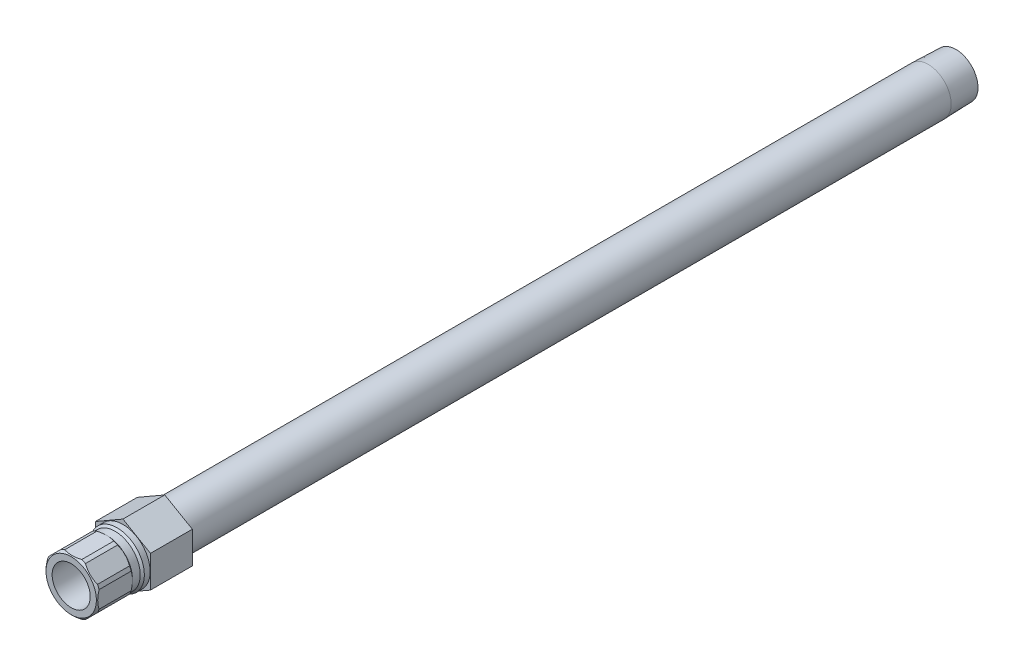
ISO-10303-21;
HEADER;
FILE_DESCRIPTION(('STEP AP214'),'2;1');
FILE_NAME('part.step','',(''),(''),'','','');
FILE_SCHEMA(('AUTOMOTIVE_DESIGN { 1 0 10303 214 1 1 1 1 }'));
ENDSEC;
DATA;
#1=APPLICATION_CONTEXT('core data for automotive mechanical design processes');
#2=APPLICATION_PROTOCOL_DEFINITION('international standard','automotive_design',2000,#1);
#3=PRODUCT_CONTEXT('',#1,'mechanical');
#4=PRODUCT('Part','Part','',(#3));
#5=PRODUCT_RELATED_PRODUCT_CATEGORY('part','',(#4));
#6=PRODUCT_DEFINITION_FORMATION('','',#4);
#7=PRODUCT_DEFINITION_CONTEXT('part definition',#1,'design');
#8=PRODUCT_DEFINITION('design','',#6,#7);
#9=PRODUCT_DEFINITION_SHAPE('','',#8);
#10=(LENGTH_UNIT() NAMED_UNIT(*) SI_UNIT(.MILLI.,.METRE.));
#11=(NAMED_UNIT(*) PLANE_ANGLE_UNIT() SI_UNIT($,.RADIAN.));
#12=(NAMED_UNIT(*) SI_UNIT($,.STERADIAN.) SOLID_ANGLE_UNIT());
#13=UNCERTAINTY_MEASURE_WITH_UNIT(LENGTH_MEASURE(1.E-05),#10,'distance_accuracy_value','');
#14=(GEOMETRIC_REPRESENTATION_CONTEXT(3) GLOBAL_UNCERTAINTY_ASSIGNED_CONTEXT((#13)) GLOBAL_UNIT_ASSIGNED_CONTEXT((#10,
#11,#12)) REPRESENTATION_CONTEXT('',''));
#15=CARTESIAN_POINT('',(0.,0.,0.));
#16=DIRECTION('',(0.,0.,1.));
#17=DIRECTION('',(1.,0.,0.));
#18=AXIS2_PLACEMENT_3D('',#15,#16,#17);
#19=CARTESIAN_POINT('',(0.,0.,0.));
#20=DIRECTION('',(0.,0.,-1.));
#21=DIRECTION('',(0.,1.,0.));
#22=AXIS2_PLACEMENT_3D('',#19,#20,#21);
#23=CYLINDRICAL_SURFACE('',#22,10.16);
#24=DIRECTION('',(0.,0.,-1.));
#25=VECTOR('',#24,1.);
#26=CARTESIAN_POINT('',(9.06826191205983,-4.58172739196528,0.));
#27=LINE('',#26,#25);
#28=CARTESIAN_POINT('',(9.06826191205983,-4.58172739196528,6.5786));
#29=VERTEX_POINT('',#28);
#30=CARTESIAN_POINT('',(9.06826191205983,-4.58172739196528,18.542));
#31=VERTEX_POINT('',#30);
#32=EDGE_CURVE('E525',#29,#31,#27,.F.);
#33=ORIENTED_EDGE('',*,*,#32,.F.);
#34=CARTESIAN_POINT('',(0.,0.,6.5786));
#35=DIRECTION('',(0.,0.,-1.));
#36=DIRECTION('',(0.,1.,0.));
#37=AXIS2_PLACEMENT_3D('',#34,#35,#36);
#38=CIRCLE('',#37,10.16);
#39=CARTESIAN_POINT('',(9.652,-3.17245898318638,6.5786));
#40=VERTEX_POINT('',#39);
#41=EDGE_CURVE('E216',#40,#29,#38,.T.);
#42=ORIENTED_EDGE('',*,*,#41,.F.);
#43=DIRECTION('',(0.,0.,-1.));
#44=VECTOR('',#43,1.);
#45=CARTESIAN_POINT('',(9.652,-3.17245898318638,0.));
#46=LINE('',#45,#44);
#47=CARTESIAN_POINT('',(9.652,-3.17245898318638,18.542));
#48=VERTEX_POINT('',#47);
#49=EDGE_CURVE('E404',#48,#40,#46,.T.);
#50=ORIENTED_EDGE('',*,*,#49,.F.);
#51=CARTESIAN_POINT('',(0.,0.,18.542));
#52=DIRECTION('',(0.,0.,-1.));
#53=DIRECTION('',(0.,1.,0.));
#54=AXIS2_PLACEMENT_3D('',#51,#52,#53);
#55=CIRCLE('',#54,10.16);
#56=EDGE_CURVE('E418',#48,#31,#55,.T.);
#57=ORIENTED_EDGE('',*,*,#56,.T.);
#58=EDGE_LOOP('',(#33,#42,#50,#57));
#59=FACE_BOUND('',#58,.T.);
#60=ADVANCED_FACE('F36',(#59),#23,.T.);
#61=DIRECTION('',(0.,0.,-1.));
#62=VECTOR('',#61,1.);
#63=CARTESIAN_POINT('',(9.652,3.17245898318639,0.));
#64=LINE('',#63,#62);
#65=CARTESIAN_POINT('',(9.652,3.1724589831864,6.57859999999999));
#66=VERTEX_POINT('',#65);
#67=CARTESIAN_POINT('',(9.652,3.17245898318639,18.542));
#68=VERTEX_POINT('',#67);
#69=EDGE_CURVE('E325',#66,#68,#64,.F.);
#70=ORIENTED_EDGE('',*,*,#69,.F.);
#71=CARTESIAN_POINT('',(9.06826191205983,4.58172739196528,6.5786));
#72=VERTEX_POINT('',#71);
#73=EDGE_CURVE('E219',#72,#66,#38,.T.);
#74=ORIENTED_EDGE('',*,*,#73,.F.);
#75=DIRECTION('',(0.,0.,-1.));
#76=VECTOR('',#75,1.);
#77=CARTESIAN_POINT('',(9.06826191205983,4.58172739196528,0.));
#78=LINE('',#77,#76);
#79=CARTESIAN_POINT('',(9.06826191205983,4.58172739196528,18.542));
#80=VERTEX_POINT('',#79);
#81=EDGE_CURVE('E397',#80,#72,#78,.T.);
#82=ORIENTED_EDGE('',*,*,#81,.F.);
#83=EDGE_CURVE('E233',#80,#68,#55,.T.);
#84=ORIENTED_EDGE('',*,*,#83,.T.);
#85=EDGE_LOOP('',(#70,#74,#82,#84));
#86=FACE_BOUND('',#85,.T.);
#87=ADVANCED_FACE('F419',(#86),#23,.T.);
#88=DIRECTION('',(0.,0.,-1.));
#89=VECTOR('',#88,1.);
#90=CARTESIAN_POINT('',(4.58172739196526,9.06826191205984,0.));
#91=LINE('',#90,#89);
#92=CARTESIAN_POINT('',(4.58172739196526,9.06826191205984,6.5786));
#93=VERTEX_POINT('',#92);
#94=CARTESIAN_POINT('',(4.58172739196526,9.06826191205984,18.542));
#95=VERTEX_POINT('',#94);
#96=EDGE_CURVE('E398',#93,#95,#91,.F.);
#97=ORIENTED_EDGE('',*,*,#96,.F.);
#98=CARTESIAN_POINT('',(3.17245898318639,9.652,6.5786));
#99=VERTEX_POINT('',#98);
#100=EDGE_CURVE('E221',#99,#93,#38,.T.);
#101=ORIENTED_EDGE('',*,*,#100,.F.);
#102=DIRECTION('',(0.,0.,-1.));
#103=VECTOR('',#102,1.);
#104=CARTESIAN_POINT('',(3.17245898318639,9.652,0.));
#105=LINE('',#104,#103);
#106=CARTESIAN_POINT('',(3.17245898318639,9.652,18.542));
#107=VERTEX_POINT('',#106);
#108=EDGE_CURVE('E391',#107,#99,#105,.T.);
#109=ORIENTED_EDGE('',*,*,#108,.F.);
#110=EDGE_CURVE('E229',#107,#95,#55,.T.);
#111=ORIENTED_EDGE('',*,*,#110,.T.);
#112=EDGE_LOOP('',(#97,#101,#109,#111));
#113=FACE_BOUND('',#112,.T.);
#114=ADVANCED_FACE('F438',(#113),#23,.T.);
#115=DIRECTION('',(0.,0.,-1.));
#116=VECTOR('',#115,1.);
#117=CARTESIAN_POINT('',(-3.17245898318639,9.652,0.));
#118=LINE('',#117,#116);
#119=CARTESIAN_POINT('',(-3.17245898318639,9.652,6.5786));
#120=VERTEX_POINT('',#119);
#121=CARTESIAN_POINT('',(-3.17245898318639,9.652,18.542));
#122=VERTEX_POINT('',#121);
#123=EDGE_CURVE('E392',#120,#122,#118,.F.);
#124=ORIENTED_EDGE('',*,*,#123,.F.);
#125=CARTESIAN_POINT('',(-4.58172739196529,9.06826191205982,6.5786));
#126=VERTEX_POINT('',#125);
#127=EDGE_CURVE('E226',#126,#120,#38,.T.);
#128=ORIENTED_EDGE('',*,*,#127,.F.);
#129=DIRECTION('',(0.,0.,-1.));
#130=VECTOR('',#129,1.);
#131=CARTESIAN_POINT('',(-4.58172739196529,9.06826191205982,0.));
#132=LINE('',#131,#130);
#133=CARTESIAN_POINT('',(-4.58172739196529,9.06826191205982,18.542));
#134=VERTEX_POINT('',#133);
#135=EDGE_CURVE('E56',#134,#126,#132,.T.);
#136=ORIENTED_EDGE('',*,*,#135,.F.);
#137=EDGE_CURVE('E225',#134,#122,#55,.T.);
#138=ORIENTED_EDGE('',*,*,#137,.T.);
#139=EDGE_LOOP('',(#124,#128,#136,#138));
#140=FACE_BOUND('',#139,.T.);
#141=ADVANCED_FACE('F433',(#140),#23,.T.);
#142=DIRECTION('',(0.,0.,-1.));
#143=VECTOR('',#142,1.);
#144=CARTESIAN_POINT('',(-9.06826191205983,4.58172739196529,0.));
#145=LINE('',#144,#143);
#146=CARTESIAN_POINT('',(-9.06826191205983,4.58172739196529,6.5786));
#147=VERTEX_POINT('',#146);
#148=CARTESIAN_POINT('',(-9.06826191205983,4.58172739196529,18.542));
#149=VERTEX_POINT('',#148);
#150=EDGE_CURVE('E388',#147,#149,#145,.F.);
#151=ORIENTED_EDGE('',*,*,#150,.F.);
#152=CARTESIAN_POINT('',(-9.652,3.17245898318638,6.5786));
#153=VERTEX_POINT('',#152);
#154=EDGE_CURVE('E441',#153,#147,#38,.T.);
#155=ORIENTED_EDGE('',*,*,#154,.F.);
#156=DIRECTION('',(0.,0.,-1.));
#157=VECTOR('',#156,1.);
#158=CARTESIAN_POINT('',(-9.652,3.17245898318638,0.));
#159=LINE('',#158,#157);
#160=CARTESIAN_POINT('',(-9.652,3.17245898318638,18.542));
#161=VERTEX_POINT('',#160);
#162=EDGE_CURVE('E64',#161,#153,#159,.T.);
#163=ORIENTED_EDGE('',*,*,#162,.F.);
#164=EDGE_CURVE('E424',#161,#149,#55,.T.);
#165=ORIENTED_EDGE('',*,*,#164,.T.);
#166=EDGE_LOOP('',(#151,#155,#163,#165));
#167=FACE_BOUND('',#166,.T.);
#168=ADVANCED_FACE('F546',(#167),#23,.T.);
#169=DIRECTION('',(0.,0.,-1.));
#170=VECTOR('',#169,1.);
#171=CARTESIAN_POINT('',(-9.652,-3.17245898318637,0.));
#172=LINE('',#171,#170);
#173=CARTESIAN_POINT('',(-9.652,-3.17245898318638,6.5786));
#174=VERTEX_POINT('',#173);
#175=CARTESIAN_POINT('',(-9.652,-3.17245898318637,18.542));
#176=VERTEX_POINT('',#175);
#177=EDGE_CURVE('E386',#174,#176,#172,.F.);
#178=ORIENTED_EDGE('',*,*,#177,.F.);
#179=CARTESIAN_POINT('',(-9.06826191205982,-4.58172739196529,6.5786));
#180=VERTEX_POINT('',#179);
#181=EDGE_CURVE('E220',#180,#174,#38,.T.);
#182=ORIENTED_EDGE('',*,*,#181,.F.);
#183=DIRECTION('',(0.,0.,-1.));
#184=VECTOR('',#183,1.);
#185=CARTESIAN_POINT('',(-9.06826191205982,-4.58172739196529,0.));
#186=LINE('',#185,#184);
#187=CARTESIAN_POINT('',(-9.06826191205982,-4.58172739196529,18.542));
#188=VERTEX_POINT('',#187);
#189=EDGE_CURVE('E263',#188,#180,#186,.T.);
#190=ORIENTED_EDGE('',*,*,#189,.F.);
#191=EDGE_CURVE('E422',#188,#176,#55,.T.);
#192=ORIENTED_EDGE('',*,*,#191,.T.);
#193=EDGE_LOOP('',(#178,#182,#190,#192));
#194=FACE_BOUND('',#193,.T.);
#195=ADVANCED_FACE('F539',(#194),#23,.T.);
#196=DIRECTION('',(0.,0.,-1.));
#197=VECTOR('',#196,1.);
#198=CARTESIAN_POINT('',(-4.58172739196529,-9.06826191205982,0.));
#199=LINE('',#198,#197);
#200=CARTESIAN_POINT('',(-4.58172739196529,-9.06826191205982,6.5786));
#201=VERTEX_POINT('',#200);
#202=CARTESIAN_POINT('',(-4.58172739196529,-9.06826191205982,18.542));
#203=VERTEX_POINT('',#202);
#204=EDGE_CURVE('E376',#201,#203,#199,.F.);
#205=ORIENTED_EDGE('',*,*,#204,.F.);
#206=CARTESIAN_POINT('',(-3.17245898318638,-9.652,6.5786));
#207=VERTEX_POINT('',#206);
#208=EDGE_CURVE('E217',#207,#201,#38,.T.);
#209=ORIENTED_EDGE('',*,*,#208,.F.);
#210=DIRECTION('',(0.,0.,-1.));
#211=VECTOR('',#210,1.);
#212=CARTESIAN_POINT('',(-3.17245898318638,-9.652,0.));
#213=LINE('',#212,#211);
#214=CARTESIAN_POINT('',(-3.17245898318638,-9.652,18.542));
#215=VERTEX_POINT('',#214);
#216=EDGE_CURVE('E194',#215,#207,#213,.T.);
#217=ORIENTED_EDGE('',*,*,#216,.F.);
#218=EDGE_CURVE('E385',#215,#203,#55,.T.);
#219=ORIENTED_EDGE('',*,*,#218,.T.);
#220=EDGE_LOOP('',(#205,#209,#217,#219));
#221=FACE_BOUND('',#220,.T.);
#222=ADVANCED_FACE('F383',(#221),#23,.T.);
#223=CARTESIAN_POINT('',(0.,0.,0.));
#224=DIRECTION('',(0.,0.,-1.));
#225=DIRECTION('',(0.,1.,0.));
#226=AXIS2_PLACEMENT_3D('',#223,#224,#225);
#227=CYLINDRICAL_SURFACE('',#226,8.5725);
#228=CARTESIAN_POINT('',(0.,0.,-300.5582));
#229=DIRECTION('',(0.,0.,-1.));
#230=DIRECTION('',(0.,1.,0.));
#231=AXIS2_PLACEMENT_3D('',#228,#229,#230);
#232=CIRCLE('',#231,8.57250000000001);
#233=CARTESIAN_POINT('',(0.,8.5725,-300.5582));
#234=VERTEX_POINT('',#233);
#235=EDGE_CURVE('E456',#234,#234,#232,.T.);
#236=ORIENTED_EDGE('',*,*,#235,.F.);
#237=EDGE_LOOP('',(#236));
#238=FACE_BOUND('',#237,.T.);
#239=CARTESIAN_POINT('',(0.,0.,-15.621));
#240=DIRECTION('',(0.,0.,1.));
#241=DIRECTION('',(1.,0.,0.));
#242=AXIS2_PLACEMENT_3D('',#239,#240,#241);
#243=CIRCLE('',#242,8.5725);
#244=CARTESIAN_POINT('',(8.5725,0.,-15.621));
#245=VERTEX_POINT('',#244);
#246=EDGE_CURVE('E471',#245,#245,#243,.F.);
#247=ORIENTED_EDGE('',*,*,#246,.T.);
#248=EDGE_LOOP('',(#247));
#249=FACE_BOUND('',#248,.T.);
#250=ADVANCED_FACE('F538',(#238,#249),#227,.T.);
#251=CARTESIAN_POINT('',(0.,0.,0.));
#252=DIRECTION('',(0.,0.,-1.));
#253=DIRECTION('',(0.,1.,0.));
#254=AXIS2_PLACEMENT_3D('',#251,#252,#253);
#255=CYLINDRICAL_SURFACE('',#254,7.112);
#256=CARTESIAN_POINT('',(0.,0.,1.524));
#257=DIRECTION('',(0.,0.,-1.));
#258=DIRECTION('',(0.,1.,0.));
#259=AXIS2_PLACEMENT_3D('',#256,#257,#258);
#260=CIRCLE('',#259,7.112);
#261=CARTESIAN_POINT('',(0.,7.112,1.524));
#262=VERTEX_POINT('',#261);
#263=EDGE_CURVE('E468',#262,#262,#260,.T.);
#264=ORIENTED_EDGE('',*,*,#263,.T.);
#265=EDGE_LOOP('',(#264));
#266=FACE_BOUND('',#265,.T.);
#267=CARTESIAN_POINT('',(0.,0.,19.304));
#268=DIRECTION('',(0.,0.,-1.));
#269=DIRECTION('',(0.,1.,0.));
#270=AXIS2_PLACEMENT_3D('',#267,#268,#269);
#271=CIRCLE('',#270,7.112);
#272=CARTESIAN_POINT('',(0.,7.112,19.304));
#273=VERTEX_POINT('',#272);
#274=EDGE_CURVE('E200',#273,#273,#271,.T.);
#275=ORIENTED_EDGE('',*,*,#274,.F.);
#276=EDGE_LOOP('',(#275));
#277=FACE_BOUND('',#276,.T.);
#278=ADVANCED_FACE('F38',(#266,#277),#255,.F.);
#279=CARTESIAN_POINT('',(0.,7.112,19.304));
#280=DIRECTION('',(0.,0.,1.));
#281=DIRECTION('',(0.,-1.,0.));
#282=AXIS2_PLACEMENT_3D('',#279,#280,#281);
#283=PLANE('',#282);
#284=ORIENTED_EDGE('',*,*,#274,.T.);
#285=EDGE_LOOP('',(#284));
#286=FACE_BOUND('',#285,.T.);
#287=CARTESIAN_POINT('',(0.,0.,19.304));
#288=DIRECTION('',(0.,0.,-1.));
#289=DIRECTION('',(0.,1.,0.));
#290=AXIS2_PLACEMENT_3D('',#287,#288,#289);
#291=CIRCLE('',#290,9.398);
#292=CARTESIAN_POINT('',(0.,9.398,19.304));
#293=VERTEX_POINT('',#292);
#294=EDGE_CURVE('E232',#293,#293,#291,.T.);
#295=ORIENTED_EDGE('',*,*,#294,.F.);
#296=EDGE_LOOP('',(#295));
#297=FACE_BOUND('',#296,.T.);
#298=ADVANCED_FACE('F269',(#286,#297),#283,.T.);
#299=CARTESIAN_POINT('',(0.,0.,18.542));
#300=DIRECTION('',(0.,0.,-1.));
#301=DIRECTION('',(0.,1.,0.));
#302=AXIS2_PLACEMENT_3D('',#299,#300,#301);
#303=CONICAL_SURFACE('',#302,10.16,0.785398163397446);
#304=CARTESIAN_POINT('',(9.06871478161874,-4.58127452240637,18.5418));
#305=CARTESIAN_POINT('',(8.89746651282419,-4.75252279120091,18.6174888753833));
#306=CARTESIAN_POINT('',(8.72454398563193,-4.92544531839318,18.6860001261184));
#307=CARTESIAN_POINT('',(8.37571487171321,-5.2742744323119,18.8068689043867));
#308=CARTESIAN_POINT('',(8.19980528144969,-5.45018402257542,18.85920901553));
#309=CARTESIAN_POINT('',(7.8498282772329,-5.80016102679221,18.9447662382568));
#310=CARTESIAN_POINT('',(7.67581225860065,-5.97417704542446,18.9783973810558));
#311=CARTESIAN_POINT('',(7.32656572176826,-6.32342358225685,19.0270891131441));
#312=CARTESIAN_POINT('',(7.15133584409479,-6.49865345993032,19.0421588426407));
#313=CARTESIAN_POINT('',(6.77605057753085,-6.87393872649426,19.0538859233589));
#314=CARTESIAN_POINT('',(6.57594647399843,-7.07404283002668,19.0476773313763));
#315=CARTESIAN_POINT('',(6.17675989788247,-7.47322940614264,19.0106603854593));
#316=CARTESIAN_POINT('',(5.97767829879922,-7.67231100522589,18.9798336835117));
#317=CARTESIAN_POINT('',(5.57666706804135,-8.07332223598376,18.8939894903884));
#318=CARTESIAN_POINT('',(5.37480504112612,-8.27518426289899,18.8383431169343));
#319=CARTESIAN_POINT('',(5.07491153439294,-8.57507776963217,18.7386783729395));
#320=CARTESIAN_POINT('',(4.97548345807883,-8.67450584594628,18.7027814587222));
#321=CARTESIAN_POINT('',(4.77762502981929,-8.87236427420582,18.6259657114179));
#322=CARTESIAN_POINT('',(4.67919445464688,-8.97079484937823,18.5850480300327));
#323=CARTESIAN_POINT('',(4.58127452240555,-9.06871478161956,18.5417999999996));
#324=B_SPLINE_CURVE_WITH_KNOTS('',3,(#304,#305,#306,#307,#308,#309,#310,#311,#312,#313,#314,
#315,#316,#317,#318,#319,#320,#321,#322,#323),.UNSPECIFIED.,.F.,.F.,(4,2,2,2,2,2,2,2,2,4),(0.,
0.761268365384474,1.52335378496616,2.26782503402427,3.01192953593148,3.85997332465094,
4.70864975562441,5.58017277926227,6.01546212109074,6.4506517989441),.UNSPECIFIED.);
#325=CARTESIAN_POINT('',(4.58172739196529,-9.06826191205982,18.542));
#326=VERTEX_POINT('',#325);
#327=EDGE_CURVE('E506',#31,#326,#324,.T.);
#328=ORIENTED_EDGE('',*,*,#327,.F.);
#329=ORIENTED_EDGE('',*,*,#56,.F.);
#330=CARTESIAN_POINT('',(9.652,-7.71050187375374,16.3483388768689));
#331=CARTESIAN_POINT('',(9.652,-7.52475481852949,16.4642553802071));
#332=CARTESIAN_POINT('',(9.652,-7.33786285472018,16.5783624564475));
#333=CARTESIAN_POINT('',(9.652,-6.96152272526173,16.8023812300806));
#334=CARTESIAN_POINT('',(9.652,-6.77207395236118,16.9122919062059));
#335=CARTESIAN_POINT('',(9.652,-6.38961701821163,17.1277502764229));
#336=CARTESIAN_POINT('',(9.652,-6.19659699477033,17.2332770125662));
#337=CARTESIAN_POINT('',(9.652,-5.80760245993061,17.4386922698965));
#338=CARTESIAN_POINT('',(9.652,-5.6116281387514,17.5385811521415));
#339=CARTESIAN_POINT('',(9.652,-5.01021259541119,17.8328232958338));
#340=CARTESIAN_POINT('',(9.652,-4.59965798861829,18.0169416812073));
#341=CARTESIAN_POINT('',(9.652,-3.76461195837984,18.3488686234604));
#342=CARTESIAN_POINT('',(9.652,-3.34014745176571,18.4967430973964));
#343=CARTESIAN_POINT('',(9.652,-2.66836152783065,18.6905975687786));
#344=CARTESIAN_POINT('',(9.652,-2.42567962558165,18.7527238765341));
#345=CARTESIAN_POINT('',(9.652,-1.9366245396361,18.860517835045));
#346=CARTESIAN_POINT('',(9.652,-1.69025117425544,18.9061846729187));
#347=CARTESIAN_POINT('',(9.652,-1.1971622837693,18.9790662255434));
#348=CARTESIAN_POINT('',(9.652,-0.95047238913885,19.0064526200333));
#349=CARTESIAN_POINT('',(9.652,-0.45571021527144,19.0423990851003));
#350=CARTESIAN_POINT('',(9.652,-0.207637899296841,19.0509586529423));
#351=CARTESIAN_POINT('',(9.652,0.333683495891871,19.048681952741));
#352=CARTESIAN_POINT('',(9.652,0.626923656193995,19.0340251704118));
#353=CARTESIAN_POINT('',(9.652,1.21094277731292,18.9786837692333));
#354=CARTESIAN_POINT('',(9.652,1.501721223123,18.9379938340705));
#355=CARTESIAN_POINT('',(9.652,2.08266136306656,18.8320509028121));
#356=CARTESIAN_POINT('',(9.652,2.3727646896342,18.7664820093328));
#357=CARTESIAN_POINT('',(9.652,2.94714147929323,18.6138865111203));
#358=CARTESIAN_POINT('',(9.652,3.23141585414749,18.5268632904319));
#359=CARTESIAN_POINT('',(9.652,3.82869981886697,18.3226103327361));
#360=CARTESIAN_POINT('',(9.652,4.14087760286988,18.2029681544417));
#361=CARTESIAN_POINT('',(9.652,4.75742701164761,17.9448741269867));
#362=CARTESIAN_POINT('',(9.652,5.0617950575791,17.8064138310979));
#363=CARTESIAN_POINT('',(9.652,5.66409479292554,17.5139015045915));
#364=CARTESIAN_POINT('',(9.652,5.96200267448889,17.3598008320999));
#365=CARTESIAN_POINT('',(9.652,6.55107386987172,17.0393844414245));
#366=CARTESIAN_POINT('',(9.652,6.84223818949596,16.8730705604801));
#367=CARTESIAN_POINT('',(9.652,7.40668231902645,16.5376791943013));
#368=CARTESIAN_POINT('',(9.652,7.68020242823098,16.3690040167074));
#369=CARTESIAN_POINT('',(9.652,8.22250898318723,16.0241853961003));
#370=CARTESIAN_POINT('',(9.652,8.49129505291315,15.848041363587));
#371=CARTESIAN_POINT('',(9.652,9.02258177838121,15.4910339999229));
#372=CARTESIAN_POINT('',(9.652,9.28511552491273,15.3102197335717));
#373=CARTESIAN_POINT('',(9.652,9.80652727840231,14.9435456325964));
#374=CARTESIAN_POINT('',(9.652,10.0654063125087,14.7576872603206));
#375=CARTESIAN_POINT('',(9.652,10.3227473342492,14.5697596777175));
#376=B_SPLINE_CURVE_WITH_KNOTS('',3,(#330,#331,#332,#333,#334,#335,#336,#337,#338,#339,#340,
#341,#342,#343,#344,#345,#346,#347,#348,#349,#350,#351,#352,#353,#354,#355,#356,#357,#358,#359,
#360,#361,#362,#363,#364,#365,#366,#367,#368,#369,#370,#371,#372,#373,#374,#375),.UNSPECIFIED.,
.F.,.F.,(4,2,2,2,2,2,2,2,2,2,2,2,2,2,2,2,2,2,2,2,2,2,4),(0.,0.656855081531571,1.31386901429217,
1.97372850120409,2.63354568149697,3.98211483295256,5.32821282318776,6.07925616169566,
6.83033658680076,7.5742601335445,8.31820354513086,9.1977741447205,10.0775244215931,
10.9688407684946,11.8600166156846,12.8622077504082,13.8648502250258,14.8707124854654,
15.8764237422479,16.8403261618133,17.8043048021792,18.7605668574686,19.7165545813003),.UNSPECIFIED.);
#377=EDGE_CURVE('E317',#68,#48,#376,.F.);
#378=ORIENTED_EDGE('',*,*,#377,.F.);
#379=ORIENTED_EDGE('',*,*,#83,.F.);
#380=CARTESIAN_POINT('',(4.58127452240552,9.06871478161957,18.5417999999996));
#381=CARTESIAN_POINT('',(4.75252279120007,8.89746651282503,18.617488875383));
#382=CARTESIAN_POINT('',(4.92544531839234,8.72454398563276,18.6860001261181));
#383=CARTESIAN_POINT('',(5.27427443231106,8.37571487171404,18.8068689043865));
#384=CARTESIAN_POINT('',(5.45018402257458,8.19980528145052,18.8592090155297));
#385=CARTESIAN_POINT('',(5.80016102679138,7.84982827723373,18.9447662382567));
#386=CARTESIAN_POINT('',(5.97417704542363,7.67581225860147,18.9783973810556));
#387=CARTESIAN_POINT('',(6.32342358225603,7.32656572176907,19.027089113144));
#388=CARTESIAN_POINT('',(6.4986534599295,7.1513358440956,19.0421588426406));
#389=CARTESIAN_POINT('',(6.87393872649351,6.77605057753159,19.0538859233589));
#390=CARTESIAN_POINT('',(7.074042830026,6.57594647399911,19.0476773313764));
#391=CARTESIAN_POINT('',(7.4732294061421,6.17675989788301,19.0106603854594));
#392=CARTESIAN_POINT('',(7.67231100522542,5.97767829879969,18.9798336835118));
#393=CARTESIAN_POINT('',(8.07332223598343,5.57666706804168,18.8939894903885));
#394=CARTESIAN_POINT('',(8.27518426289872,5.37480504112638,18.8383431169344));
#395=CARTESIAN_POINT('',(8.57507776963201,5.07491153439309,18.7386783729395));
#396=CARTESIAN_POINT('',(8.67450584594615,4.97548345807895,18.7027814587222));
#397=CARTESIAN_POINT('',(8.87236427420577,4.77762502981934,18.6259657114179));
#398=CARTESIAN_POINT('',(8.9707948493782,4.6791944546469,18.5850480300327));
#399=CARTESIAN_POINT('',(9.06871478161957,4.58127452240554,18.5417999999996));
#400=B_SPLINE_CURVE_WITH_KNOTS('',3,(#380,#381,#382,#383,#384,#385,#386,#387,#388,#389,#390,
#391,#392,#393,#394,#395,#396,#397,#398,#399),.UNSPECIFIED.,.F.,.F.,(4,2,2,2,2,2,2,2,2,4),(0.,
0.761268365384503,1.52335378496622,2.26782503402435,3.01192953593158,3.85997332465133,
4.70864975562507,5.58017277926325,6.01546212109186,6.45065179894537),.UNSPECIFIED.);
#401=EDGE_CURVE('E309',#95,#80,#400,.T.);
#402=ORIENTED_EDGE('',*,*,#401,.F.);
#403=ORIENTED_EDGE('',*,*,#110,.F.);
#404=CARTESIAN_POINT('',(-7.71050187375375,9.652,16.3483388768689));
#405=CARTESIAN_POINT('',(-7.5247548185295,9.652,16.4642553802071));
#406=CARTESIAN_POINT('',(-7.33786285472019,9.652,16.5783624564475));
#407=CARTESIAN_POINT('',(-6.96152272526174,9.652,16.8023812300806));
#408=CARTESIAN_POINT('',(-6.77207395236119,9.652,16.9122919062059));
#409=CARTESIAN_POINT('',(-6.38961701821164,9.652,17.1277502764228));
#410=CARTESIAN_POINT('',(-6.19659699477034,9.652,17.2332770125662));
#411=CARTESIAN_POINT('',(-5.80760245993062,9.652,17.4386922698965));
#412=CARTESIAN_POINT('',(-5.61162813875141,9.652,17.5385811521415));
#413=CARTESIAN_POINT('',(-5.0102125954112,9.652,17.8328232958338));
#414=CARTESIAN_POINT('',(-4.5996579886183,9.652,18.0169416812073));
#415=CARTESIAN_POINT('',(-3.76461195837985,9.652,18.3488686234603));
#416=CARTESIAN_POINT('',(-3.34014745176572,9.652,18.4967430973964));
#417=CARTESIAN_POINT('',(-2.66836152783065,9.652,18.6905975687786));
#418=CARTESIAN_POINT('',(-2.42567962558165,9.652,18.7527238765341));
#419=CARTESIAN_POINT('',(-1.9366245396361,9.652,18.860517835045));
#420=CARTESIAN_POINT('',(-1.69025117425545,9.652,18.9061846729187));
#421=CARTESIAN_POINT('',(-1.19716228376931,9.652,18.9790662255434));
#422=CARTESIAN_POINT('',(-0.950472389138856,9.652,19.0064526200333));
#423=CARTESIAN_POINT('',(-0.455710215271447,9.652,19.0423990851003));
#424=CARTESIAN_POINT('',(-0.207637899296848,9.652,19.0509586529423));
#425=CARTESIAN_POINT('',(0.333683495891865,9.652,19.048681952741));
#426=CARTESIAN_POINT('',(0.626923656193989,9.652,19.0340251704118));
#427=CARTESIAN_POINT('',(1.21094277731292,9.652,18.9786837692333));
#428=CARTESIAN_POINT('',(1.50172122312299,9.652,18.9379938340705));
#429=CARTESIAN_POINT('',(2.08266136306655,9.652,18.8320509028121));
#430=CARTESIAN_POINT('',(2.3727646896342,9.652,18.7664820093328));
#431=CARTESIAN_POINT('',(2.94714147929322,9.652,18.6138865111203));
#432=CARTESIAN_POINT('',(3.23141585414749,9.652,18.5268632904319));
#433=CARTESIAN_POINT('',(3.82869981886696,9.652,18.3226103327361));
#434=CARTESIAN_POINT('',(4.14087760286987,9.652,18.2029681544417));
#435=CARTESIAN_POINT('',(4.7574270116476,9.652,17.9448741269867));
#436=CARTESIAN_POINT('',(5.06179505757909,9.652,17.8064138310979));
#437=CARTESIAN_POINT('',(5.66409479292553,9.652,17.5139015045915));
#438=CARTESIAN_POINT('',(5.96200267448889,9.652,17.3598008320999));
#439=CARTESIAN_POINT('',(6.55107386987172,9.652,17.0393844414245));
#440=CARTESIAN_POINT('',(6.84223818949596,9.652,16.8730705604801));
#441=CARTESIAN_POINT('',(7.40668231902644,9.652,16.5376791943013));
#442=CARTESIAN_POINT('',(7.68020242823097,9.652,16.3690040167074));
#443=CARTESIAN_POINT('',(8.22250898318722,9.652,16.0241853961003));
#444=CARTESIAN_POINT('',(8.49129505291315,9.652,15.848041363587));
#445=CARTESIAN_POINT('',(9.0225817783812,9.652,15.4910339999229));
#446=CARTESIAN_POINT('',(9.28511552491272,9.652,15.3102197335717));
#447=CARTESIAN_POINT('',(9.8065272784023,9.652,14.9435456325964));
#448=CARTESIAN_POINT('',(10.0654063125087,9.652,14.7576872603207));
#449=CARTESIAN_POINT('',(10.3227473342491,9.652,14.5697596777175));
#450=B_SPLINE_CURVE_WITH_KNOTS('',3,(#404,#405,#406,#407,#408,#409,#410,#411,#412,#413,#414,
#415,#416,#417,#418,#419,#420,#421,#422,#423,#424,#425,#426,#427,#428,#429,#430,#431,#432,#433,
#434,#435,#436,#437,#438,#439,#440,#441,#442,#443,#444,#445,#446,#447,#448,#449),.UNSPECIFIED.,
.F.,.F.,(4,2,2,2,2,2,2,2,2,2,2,2,2,2,2,2,2,2,2,2,2,2,4),(0.,0.656855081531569,1.31386901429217,
1.97372850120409,2.63354568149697,3.98211483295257,5.32821282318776,6.07925616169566,
6.83033658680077,7.57426013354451,8.31820354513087,9.1977741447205,10.0775244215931,
10.9688407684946,11.8600166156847,12.8622077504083,13.8648502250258,14.8707124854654,
15.8764237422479,16.8403261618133,17.8043048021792,18.7605668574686,19.7165545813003),.UNSPECIFIED.);
#451=EDGE_CURVE('E301',#122,#107,#450,.T.);
#452=ORIENTED_EDGE('',*,*,#451,.F.);
#453=ORIENTED_EDGE('',*,*,#137,.F.);
#454=CARTESIAN_POINT('',(-9.06871478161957,4.58127452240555,18.5417999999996));
#455=CARTESIAN_POINT('',(-8.89746651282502,4.75252279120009,18.617488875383));
#456=CARTESIAN_POINT('',(-8.72454398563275,4.92544531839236,18.6860001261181));
#457=CARTESIAN_POINT('',(-8.37571487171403,5.27427443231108,18.8068689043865));
#458=CARTESIAN_POINT('',(-8.19980528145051,5.4501840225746,18.8592090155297));
#459=CARTESIAN_POINT('',(-7.84982827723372,5.80016102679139,18.9447662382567));
#460=CARTESIAN_POINT('',(-7.67581225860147,5.97417704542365,18.9783973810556));
#461=CARTESIAN_POINT('',(-7.32656572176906,6.32342358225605,19.027089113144));
#462=CARTESIAN_POINT('',(-7.15133584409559,6.49865345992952,19.0421588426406));
#463=CARTESIAN_POINT('',(-6.77605057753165,6.87393872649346,19.0538859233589));
#464=CARTESIAN_POINT('',(-6.57594647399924,7.07404283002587,19.0476773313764));
#465=CARTESIAN_POINT('',(-6.17675989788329,7.47322940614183,19.0106603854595));
#466=CARTESIAN_POINT('',(-5.97767829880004,7.67231100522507,18.9798336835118));
#467=CARTESIAN_POINT('',(-5.57666706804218,8.07332223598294,18.8939894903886));
#468=CARTESIAN_POINT('',(-5.37480504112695,8.27518426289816,18.8383431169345));
#469=CARTESIAN_POINT('',(-5.07491153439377,8.57507776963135,18.7386783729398));
#470=CARTESIAN_POINT('',(-4.97548345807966,8.67450584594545,18.7027814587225));
#471=CARTESIAN_POINT('',(-4.77762502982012,8.872364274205,18.6259657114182));
#472=CARTESIAN_POINT('',(-4.67919445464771,8.9707948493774,18.585048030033));
#473=CARTESIAN_POINT('',(-4.58127452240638,9.06871478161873,18.5418));
#474=B_SPLINE_CURVE_WITH_KNOTS('',3,(#454,#455,#456,#457,#458,#459,#460,#461,#462,#463,#464,
#465,#466,#467,#468,#469,#470,#471,#472,#473),.UNSPECIFIED.,.F.,.F.,(4,2,2,2,2,2,2,2,2,4),(0.,
0.761268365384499,1.52335378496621,2.26782503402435,3.01192953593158,3.85997332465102,
4.70864975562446,5.5801727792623,6.01546212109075,6.4506517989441),.UNSPECIFIED.);
#475=EDGE_CURVE('E292',#149,#134,#474,.T.);
#476=ORIENTED_EDGE('',*,*,#475,.F.);
#477=ORIENTED_EDGE('',*,*,#164,.F.);
#478=CARTESIAN_POINT('',(-9.652,-7.71050187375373,16.3483388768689));
#479=CARTESIAN_POINT('',(-9.652,-7.52475481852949,16.4642553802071));
#480=CARTESIAN_POINT('',(-9.652,-7.33786285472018,16.5783624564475));
#481=CARTESIAN_POINT('',(-9.652,-6.96152272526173,16.8023812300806));
#482=CARTESIAN_POINT('',(-9.652,-6.77207395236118,16.9122919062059));
#483=CARTESIAN_POINT('',(-9.652,-6.38961701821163,17.1277502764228));
#484=CARTESIAN_POINT('',(-9.652,-6.19659699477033,17.2332770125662));
#485=CARTESIAN_POINT('',(-9.652,-5.8076024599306,17.4386922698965));
#486=CARTESIAN_POINT('',(-9.652,-5.6116281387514,17.5385811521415));
#487=CARTESIAN_POINT('',(-9.652,-5.01021259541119,17.8328232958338));
#488=CARTESIAN_POINT('',(-9.652,-4.59965798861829,18.0169416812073));
#489=CARTESIAN_POINT('',(-9.652,-3.76461195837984,18.3488686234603));
#490=CARTESIAN_POINT('',(-9.652,-3.34014745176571,18.4967430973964));
#491=CARTESIAN_POINT('',(-9.652,-2.66836152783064,18.6905975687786));
#492=CARTESIAN_POINT('',(-9.652,-2.42567962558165,18.7527238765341));
#493=CARTESIAN_POINT('',(-9.652,-1.9366245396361,18.860517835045));
#494=CARTESIAN_POINT('',(-9.652,-1.69025117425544,18.9061846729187));
#495=CARTESIAN_POINT('',(-9.652,-1.1971622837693,18.9790662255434));
#496=CARTESIAN_POINT('',(-9.652,-0.950472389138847,19.0064526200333));
#497=CARTESIAN_POINT('',(-9.652,-0.455710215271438,19.0423990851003));
#498=CARTESIAN_POINT('',(-9.652,-0.207637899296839,19.0509586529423));
#499=CARTESIAN_POINT('',(-9.652,0.333683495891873,19.048681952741));
#500=CARTESIAN_POINT('',(-9.652,0.626923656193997,19.0340251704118));
#501=CARTESIAN_POINT('',(-9.652,1.21094277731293,18.9786837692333));
#502=CARTESIAN_POINT('',(-9.652,1.501721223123,18.9379938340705));
#503=CARTESIAN_POINT('',(-9.652,2.08266136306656,18.8320509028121));
#504=CARTESIAN_POINT('',(-9.652,2.3727646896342,18.7664820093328));
#505=CARTESIAN_POINT('',(-9.652,2.94714147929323,18.6138865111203));
#506=CARTESIAN_POINT('',(-9.652,3.23141585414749,18.5268632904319));
#507=CARTESIAN_POINT('',(-9.652,3.82869981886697,18.3226103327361));
#508=CARTESIAN_POINT('',(-9.652,4.14087760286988,18.2029681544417));
#509=CARTESIAN_POINT('',(-9.652,4.75742701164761,17.9448741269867));
#510=CARTESIAN_POINT('',(-9.652,5.0617950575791,17.8064138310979));
#511=CARTESIAN_POINT('',(-9.652,5.66409479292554,17.5139015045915));
#512=CARTESIAN_POINT('',(-9.652,5.9620026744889,17.3598008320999));
#513=CARTESIAN_POINT('',(-9.652,6.55107386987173,17.0393844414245));
#514=CARTESIAN_POINT('',(-9.652,6.84223818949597,16.8730705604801));
#515=CARTESIAN_POINT('',(-9.652,7.40668231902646,16.5376791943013));
#516=CARTESIAN_POINT('',(-9.652,7.68020242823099,16.3690040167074));
#517=CARTESIAN_POINT('',(-9.652,8.22250898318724,16.0241853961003));
#518=CARTESIAN_POINT('',(-9.652,8.49129505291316,15.848041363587));
#519=CARTESIAN_POINT('',(-9.652,9.02258177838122,15.4910339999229));
#520=CARTESIAN_POINT('',(-9.652,9.28511552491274,15.3102197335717));
#521=CARTESIAN_POINT('',(-9.652,9.80652727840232,14.9435456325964));
#522=CARTESIAN_POINT('',(-9.652,10.0654063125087,14.7576872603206));
#523=CARTESIAN_POINT('',(-9.652,10.3227473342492,14.5697596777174));
#524=B_SPLINE_CURVE_WITH_KNOTS('',3,(#478,#479,#480,#481,#482,#483,#484,#485,#486,#487,#488,
#489,#490,#491,#492,#493,#494,#495,#496,#497,#498,#499,#500,#501,#502,#503,#504,#505,#506,#507,
#508,#509,#510,#511,#512,#513,#514,#515,#516,#517,#518,#519,#520,#521,#522,#523),.UNSPECIFIED.,
.F.,.F.,(4,2,2,2,2,2,2,2,2,2,2,2,2,2,2,2,2,2,2,2,2,2,4),(0.,0.656855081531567,1.31386901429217,
1.97372850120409,2.63354568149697,3.98211483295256,5.32821282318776,6.07925616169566,
6.83033658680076,7.5742601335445,8.31820354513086,9.1977741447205,10.0775244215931,
10.9688407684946,11.8600166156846,12.8622077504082,13.8648502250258,14.8707124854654,
15.8764237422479,16.8403261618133,17.8043048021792,18.7605668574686,19.7165545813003),.UNSPECIFIED.);
#525=EDGE_CURVE('E284',#176,#161,#524,.T.);
#526=ORIENTED_EDGE('',*,*,#525,.F.);
#527=ORIENTED_EDGE('',*,*,#191,.F.);
#528=CARTESIAN_POINT('',(-4.58127452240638,-9.06871478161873,18.5418));
#529=CARTESIAN_POINT('',(-4.75252279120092,-8.89746651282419,18.6174888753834));
#530=CARTESIAN_POINT('',(-4.92544531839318,-8.72454398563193,18.6860001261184));
#531=CARTESIAN_POINT('',(-5.2742744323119,-8.37571487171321,18.8068689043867));
#532=CARTESIAN_POINT('',(-5.45018402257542,-8.19980528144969,18.85920901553));
#533=CARTESIAN_POINT('',(-5.80016102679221,-7.8498282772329,18.9447662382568));
#534=CARTESIAN_POINT('',(-5.97417704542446,-7.67581225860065,18.9783973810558));
#535=CARTESIAN_POINT('',(-6.32342358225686,-7.32656572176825,19.0270891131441));
#536=CARTESIAN_POINT('',(-6.49865345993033,-7.15133584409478,19.0421588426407));
#537=CARTESIAN_POINT('',(-6.87393872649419,-6.77605057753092,19.0538859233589));
#538=CARTESIAN_POINT('',(-7.07404283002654,-6.57594647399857,19.0476773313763));
#539=CARTESIAN_POINT('',(-7.47322940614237,-6.17675989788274,19.0106603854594));
#540=CARTESIAN_POINT('',(-7.67231100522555,-5.97767829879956,18.9798336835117));
#541=CARTESIAN_POINT('',(-8.07332223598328,-5.57666706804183,18.8939894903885));
#542=CARTESIAN_POINT('',(-8.27518426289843,-5.37480504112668,18.8383431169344));
#543=CARTESIAN_POINT('',(-8.57507776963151,-5.0749115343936,18.7386783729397));
#544=CARTESIAN_POINT('',(-8.67450584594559,-4.97548345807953,18.7027814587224));
#545=CARTESIAN_POINT('',(-8.87236427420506,-4.77762502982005,18.6259657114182));
#546=CARTESIAN_POINT('',(-8.97079484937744,-4.67919445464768,18.585048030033));
#547=CARTESIAN_POINT('',(-9.06871478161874,-4.58127452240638,18.5418));
#548=B_SPLINE_CURVE_WITH_KNOTS('',3,(#528,#529,#530,#531,#532,#533,#534,#535,#536,#537,#538,
#539,#540,#541,#542,#543,#544,#545,#546,#547),.UNSPECIFIED.,.F.,.F.,(4,2,2,2,2,2,2,2,2,4),(0.,
0.761268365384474,1.52335378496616,2.26782503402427,3.01192953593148,3.85997332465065,
4.70864975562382,5.58017277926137,6.01546212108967,6.45065179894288),.UNSPECIFIED.);
#549=EDGE_CURVE('E277',#203,#188,#548,.T.);
#550=ORIENTED_EDGE('',*,*,#549,.F.);
#551=ORIENTED_EDGE('',*,*,#218,.F.);
#552=CARTESIAN_POINT('',(-7.71050187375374,-9.652,16.3483388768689));
#553=CARTESIAN_POINT('',(-7.52475481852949,-9.652,16.4642553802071));
#554=CARTESIAN_POINT('',(-7.33786285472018,-9.652,16.5783624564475));
#555=CARTESIAN_POINT('',(-6.96152272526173,-9.652,16.8023812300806));
#556=CARTESIAN_POINT('',(-6.77207395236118,-9.652,16.9122919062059));
#557=CARTESIAN_POINT('',(-6.38961701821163,-9.652,17.1277502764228));
#558=CARTESIAN_POINT('',(-6.19659699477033,-9.652,17.2332770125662));
#559=CARTESIAN_POINT('',(-5.80760245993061,-9.652,17.4386922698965));
#560=CARTESIAN_POINT('',(-5.6116281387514,-9.652,17.5385811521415));
#561=CARTESIAN_POINT('',(-5.01021259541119,-9.652,17.8328232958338));
#562=CARTESIAN_POINT('',(-4.59965798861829,-9.652,18.0169416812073));
#563=CARTESIAN_POINT('',(-3.76461195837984,-9.652,18.3488686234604));
#564=CARTESIAN_POINT('',(-3.34014745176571,-9.652,18.4967430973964));
#565=CARTESIAN_POINT('',(-2.66836152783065,-9.652,18.6905975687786));
#566=CARTESIAN_POINT('',(-2.42567962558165,-9.652,18.7527238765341));
#567=CARTESIAN_POINT('',(-1.9366245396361,-9.652,18.860517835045));
#568=CARTESIAN_POINT('',(-1.69025117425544,-9.652,18.9061846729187));
#569=CARTESIAN_POINT('',(-1.1971622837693,-9.652,18.9790662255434));
#570=CARTESIAN_POINT('',(-0.950472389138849,-9.652,19.0064526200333));
#571=CARTESIAN_POINT('',(-0.45571021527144,-9.652,19.0423990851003));
#572=CARTESIAN_POINT('',(-0.20763789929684,-9.652,19.0509586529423));
#573=CARTESIAN_POINT('',(0.333683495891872,-9.652,19.048681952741));
#574=CARTESIAN_POINT('',(0.626923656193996,-9.652,19.0340251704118));
#575=CARTESIAN_POINT('',(1.21094277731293,-9.652,18.9786837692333));
#576=CARTESIAN_POINT('',(1.501721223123,-9.652,18.9379938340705));
#577=CARTESIAN_POINT('',(2.08266136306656,-9.652,18.8320509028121));
#578=CARTESIAN_POINT('',(2.3727646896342,-9.652,18.7664820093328));
#579=CARTESIAN_POINT('',(2.94714147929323,-9.652,18.6138865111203));
#580=CARTESIAN_POINT('',(3.23141585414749,-9.652,18.5268632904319));
#581=CARTESIAN_POINT('',(3.82869981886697,-9.652,18.3226103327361));
#582=CARTESIAN_POINT('',(4.14087760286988,-9.652,18.2029681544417));
#583=CARTESIAN_POINT('',(4.75742701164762,-9.652,17.9448741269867));
#584=CARTESIAN_POINT('',(5.0617950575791,-9.652,17.8064138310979));
#585=CARTESIAN_POINT('',(5.66409479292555,-9.652,17.5139015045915));
#586=CARTESIAN_POINT('',(5.9620026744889,-9.652,17.3598008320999));
#587=CARTESIAN_POINT('',(6.55107386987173,-9.652,17.0393844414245));
#588=CARTESIAN_POINT('',(6.84223818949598,-9.652,16.8730705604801));
#589=CARTESIAN_POINT('',(7.40668231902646,-9.652,16.5376791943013));
#590=CARTESIAN_POINT('',(7.68020242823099,-9.652,16.3690040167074));
#591=CARTESIAN_POINT('',(8.22250898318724,-9.652,16.0241853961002));
#592=CARTESIAN_POINT('',(8.49129505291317,-9.652,15.848041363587));
#593=CARTESIAN_POINT('',(9.02258177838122,-9.652,15.4910339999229));
#594=CARTESIAN_POINT('',(9.28511552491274,-9.652,15.3102197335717));
#595=CARTESIAN_POINT('',(9.80652727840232,-9.652,14.9435456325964));
#596=CARTESIAN_POINT('',(10.0654063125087,-9.652,14.7576872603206));
#597=CARTESIAN_POINT('',(10.3227473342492,-9.652,14.5697596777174));
#598=B_SPLINE_CURVE_WITH_KNOTS('',3,(#552,#553,#554,#555,#556,#557,#558,#559,#560,#561,#562,
#563,#564,#565,#566,#567,#568,#569,#570,#571,#572,#573,#574,#575,#576,#577,#578,#579,#580,#581,
#582,#583,#584,#585,#586,#587,#588,#589,#590,#591,#592,#593,#594,#595,#596,#597),.UNSPECIFIED.,
.F.,.F.,(4,2,2,2,2,2,2,2,2,2,2,2,2,2,2,2,2,2,2,2,2,2,4),(0.,0.656855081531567,1.31386901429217,
1.97372850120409,2.63354568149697,3.98211483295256,5.32821282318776,6.07925616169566,
6.83033658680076,7.5742601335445,8.31820354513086,9.1977741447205,10.0775244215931,
10.9688407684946,11.8600166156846,12.8622077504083,13.8648502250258,14.8707124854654,
15.8764237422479,16.8403261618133,17.8043048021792,18.7605668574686,19.7165545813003),.UNSPECIFIED.);
#599=CARTESIAN_POINT('',(3.17245898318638,-9.652,18.542));
#600=VERTEX_POINT('',#599);
#601=EDGE_CURVE('E210',#600,#215,#598,.F.);
#602=ORIENTED_EDGE('',*,*,#601,.F.);
#603=EDGE_CURVE('E209',#326,#600,#55,.T.);
#604=ORIENTED_EDGE('',*,*,#603,.F.);
#605=EDGE_LOOP('',(#328,#329,#378,#379,#402,#403,#452,#453,#476,#477,#526,#527,#550,#551,#602,#604));
#606=FACE_BOUND('',#605,.T.);
#607=ORIENTED_EDGE('',*,*,#294,.T.);
#608=EDGE_LOOP('',(#607));
#609=FACE_BOUND('',#608,.T.);
#610=ADVANCED_FACE('F266',(#606,#609),#303,.T.);
#611=DIRECTION('',(0.,0.,-1.));
#612=VECTOR('',#611,1.);
#613=CARTESIAN_POINT('',(4.58172739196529,-9.06826191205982,0.));
#614=LINE('',#613,#612);
#615=CARTESIAN_POINT('',(4.58172739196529,-9.06826191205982,6.5786));
#616=VERTEX_POINT('',#615);
#617=EDGE_CURVE('E324',#326,#616,#614,.T.);
#618=ORIENTED_EDGE('',*,*,#617,.F.);
#619=ORIENTED_EDGE('',*,*,#603,.T.);
#620=DIRECTION('',(0.,0.,-1.));
#621=VECTOR('',#620,1.);
#622=CARTESIAN_POINT('',(3.17245898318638,-9.652,0.));
#623=LINE('',#622,#621);
#624=CARTESIAN_POINT('',(3.1724589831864,-9.652,6.57859999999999));
#625=VERTEX_POINT('',#624);
#626=EDGE_CURVE('E191',#625,#600,#623,.F.);
#627=ORIENTED_EDGE('',*,*,#626,.F.);
#628=EDGE_CURVE('E207',#616,#625,#38,.T.);
#629=ORIENTED_EDGE('',*,*,#628,.F.);
#630=EDGE_LOOP('',(#618,#619,#627,#629));
#631=FACE_BOUND('',#630,.T.);
#632=ADVANCED_FACE('F206',(#631),#23,.T.);
#633=CARTESIAN_POINT('',(0.,0.,5.8166));
#634=DIRECTION('',(0.,0.,1.));
#635=DIRECTION('',(0.,-1.,0.));
#636=AXIS2_PLACEMENT_3D('',#633,#634,#635);
#637=CONICAL_SURFACE('',#636,9.398,0.785398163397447);
#638=CARTESIAN_POINT('',(4.58127452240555,-9.06871478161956,6.57880000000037));
#639=CARTESIAN_POINT('',(4.75252279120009,-8.89746651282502,6.50311112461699));
#640=CARTESIAN_POINT('',(4.92544531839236,-8.72454398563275,6.4345998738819));
#641=CARTESIAN_POINT('',(5.27427443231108,-8.37571487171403,6.31373109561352));
#642=CARTESIAN_POINT('',(5.4501840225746,-8.19980528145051,6.26139098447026));
#643=CARTESIAN_POINT('',(5.8001610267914,-7.84982827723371,6.17583376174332));
#644=CARTESIAN_POINT('',(5.97417704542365,-7.67581225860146,6.14220261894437));
#645=CARTESIAN_POINT('',(6.32342358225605,-7.32656572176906,6.09351088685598));
#646=CARTESIAN_POINT('',(6.49865345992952,-7.15133584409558,6.07844115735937));
#647=CARTESIAN_POINT('',(6.87393872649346,-6.77605057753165,6.06671407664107));
#648=CARTESIAN_POINT('',(7.07404283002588,-6.57594647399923,6.07292266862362));
#649=CARTESIAN_POINT('',(7.47322940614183,-6.17675989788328,6.10993961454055));
#650=CARTESIAN_POINT('',(7.67231100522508,-5.97767829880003,6.14076631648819));
#651=CARTESIAN_POINT('',(8.07332223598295,-5.57666706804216,6.22661050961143));
#652=CARTESIAN_POINT('',(8.27518426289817,-5.37480504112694,6.28225688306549));
#653=CARTESIAN_POINT('',(8.57507776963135,-5.07491153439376,6.38192162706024));
#654=CARTESIAN_POINT('',(8.67450584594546,-4.97548345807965,6.41781854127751));
#655=CARTESIAN_POINT('',(8.872364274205,-4.77762502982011,6.49463428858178));
#656=CARTESIAN_POINT('',(8.97079484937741,-4.6791944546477,6.53555196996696));
#657=CARTESIAN_POINT('',(9.06871478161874,-4.58127452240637,6.5788));
#658=B_SPLINE_CURVE_WITH_KNOTS('',3,(#638,#639,#640,#641,#642,#643,#644,#645,#646,#647,#648,
#649,#650,#651,#652,#653,#654,#655,#656,#657),.UNSPECIFIED.,.F.,.F.,(4,2,2,2,2,2,2,2,2,4),(0.,
0.761268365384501,1.52335378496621,2.26782503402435,3.01192953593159,3.85997332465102,
4.70864975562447,5.58017277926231,6.01546212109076,6.45065179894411),.UNSPECIFIED.);
#659=EDGE_CURVE('E12',#616,#29,#658,.T.);
#660=ORIENTED_EDGE('',*,*,#659,.F.);
#661=ORIENTED_EDGE('',*,*,#628,.T.);
#662=CARTESIAN_POINT('',(-7.71050187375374,-9.652,8.77226112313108));
#663=CARTESIAN_POINT('',(-7.52475481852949,-9.652,8.65634461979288));
#664=CARTESIAN_POINT('',(-7.33786285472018,-9.652,8.54223754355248));
#665=CARTESIAN_POINT('',(-6.96152272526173,-9.652,8.31821876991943));
#666=CARTESIAN_POINT('',(-6.77207395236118,-9.652,8.20830809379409));
#667=CARTESIAN_POINT('',(-6.38961701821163,-9.652,7.99284972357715));
#668=CARTESIAN_POINT('',(-6.19659699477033,-9.652,7.88732298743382));
#669=CARTESIAN_POINT('',(-5.80760245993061,-9.652,7.6819077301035));
#670=CARTESIAN_POINT('',(-5.6116281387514,-9.652,7.58201884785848));
#671=CARTESIAN_POINT('',(-5.0102125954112,-9.652,7.28777670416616));
#672=CARTESIAN_POINT('',(-4.59965798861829,-9.652,7.10365831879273));
#673=CARTESIAN_POINT('',(-3.76461195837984,-9.652,6.77173137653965));
#674=CARTESIAN_POINT('',(-3.34014745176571,-9.652,6.6238569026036));
#675=CARTESIAN_POINT('',(-2.66836152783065,-9.652,6.43000243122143));
#676=CARTESIAN_POINT('',(-2.42567962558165,-9.652,6.36787612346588));
#677=CARTESIAN_POINT('',(-1.9366245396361,-9.652,6.26008216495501));
#678=CARTESIAN_POINT('',(-1.69025117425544,-9.652,6.21441532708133));
#679=CARTESIAN_POINT('',(-1.1971622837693,-9.652,6.1415337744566));
#680=CARTESIAN_POINT('',(-0.950472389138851,-9.652,6.11414737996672));
#681=CARTESIAN_POINT('',(-0.455710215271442,-9.652,6.07820091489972));
#682=CARTESIAN_POINT('',(-0.207637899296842,-9.652,6.06964134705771));
#683=CARTESIAN_POINT('',(0.333683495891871,-9.652,6.07191804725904));
#684=CARTESIAN_POINT('',(0.626923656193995,-9.652,6.08657482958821));
#685=CARTESIAN_POINT('',(1.21094277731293,-9.652,6.14191623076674));
#686=CARTESIAN_POINT('',(1.501721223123,-9.652,6.18260616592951));
#687=CARTESIAN_POINT('',(2.08266136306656,-9.652,6.28854909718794));
#688=CARTESIAN_POINT('',(2.37276468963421,-9.652,6.35411799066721));
#689=CARTESIAN_POINT('',(2.94714147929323,-9.652,6.50671348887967));
#690=CARTESIAN_POINT('',(3.2314158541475,-9.652,6.59373670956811));
#691=CARTESIAN_POINT('',(3.82869981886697,-9.652,6.79798966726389));
#692=CARTESIAN_POINT('',(4.14087760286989,-9.652,6.91763184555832));
#693=CARTESIAN_POINT('',(4.75742701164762,-9.652,7.17572587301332));
#694=CARTESIAN_POINT('',(5.06179505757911,-9.652,7.31418616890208));
#695=CARTESIAN_POINT('',(5.66409479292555,-9.652,7.60669849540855));
#696=CARTESIAN_POINT('',(5.96200267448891,-9.652,7.76079916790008));
#697=CARTESIAN_POINT('',(6.55107386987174,-9.652,8.08121555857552));
#698=CARTESIAN_POINT('',(6.84223818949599,-9.652,8.24752943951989));
#699=CARTESIAN_POINT('',(7.40668231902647,-9.652,8.58292080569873));
#700=CARTESIAN_POINT('',(7.680202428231,-9.652,8.75159598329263));
#701=CARTESIAN_POINT('',(8.22250898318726,-9.652,9.09641460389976));
#702=CARTESIAN_POINT('',(8.49129505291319,-9.652,9.27255863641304));
#703=CARTESIAN_POINT('',(9.02258177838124,-9.652,9.62956600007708));
#704=CARTESIAN_POINT('',(9.28511552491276,-9.652,9.81038026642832));
#705=CARTESIAN_POINT('',(9.80652727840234,-9.652,10.1770543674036));
#706=CARTESIAN_POINT('',(10.0654063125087,-9.652,10.3629127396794));
#707=CARTESIAN_POINT('',(10.3227473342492,-9.652,10.5508403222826));
#708=B_SPLINE_CURVE_WITH_KNOTS('',3,(#662,#663,#664,#665,#666,#667,#668,#669,#670,#671,#672,
#673,#674,#675,#676,#677,#678,#679,#680,#681,#682,#683,#684,#685,#686,#687,#688,#689,#690,#691,
#692,#693,#694,#695,#696,#697,#698,#699,#700,#701,#702,#703,#704,#705,#706,#707),.UNSPECIFIED.,
.F.,.F.,(4,2,2,2,2,2,2,2,2,2,2,2,2,2,2,2,2,2,2,2,2,2,4),(0.,0.656855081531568,1.31386901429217,
1.97372850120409,2.63354568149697,3.98211483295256,5.32821282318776,6.07925616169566,
6.83033658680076,7.5742601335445,8.31820354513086,9.1977741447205,10.0775244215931,
10.9688407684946,11.8600166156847,12.8622077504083,13.8648502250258,14.8707124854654,
15.8764237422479,16.8403261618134,17.8043048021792,18.7605668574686,19.7165545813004),.UNSPECIFIED.);
#709=EDGE_CURVE('E188',#207,#625,#708,.T.);
#710=ORIENTED_EDGE('',*,*,#709,.F.);
#711=ORIENTED_EDGE('',*,*,#208,.T.);
#712=CARTESIAN_POINT('',(-9.06871478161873,-4.58127452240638,6.5788));
#713=CARTESIAN_POINT('',(-8.89746651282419,-4.75252279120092,6.50311112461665));
#714=CARTESIAN_POINT('',(-8.72454398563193,-4.92544531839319,6.43459987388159));
#715=CARTESIAN_POINT('',(-8.37571487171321,-5.2742744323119,6.31373109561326));
#716=CARTESIAN_POINT('',(-8.19980528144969,-5.45018402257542,6.26139098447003));
#717=CARTESIAN_POINT('',(-7.8498282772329,-5.80016102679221,6.17583376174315));
#718=CARTESIAN_POINT('',(-7.67581225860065,-5.97417704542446,6.14220261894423));
#719=CARTESIAN_POINT('',(-7.32656572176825,-6.32342358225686,6.0935108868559));
#720=CARTESIAN_POINT('',(-7.15133584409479,-6.49865345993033,6.07844115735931));
#721=CARTESIAN_POINT('',(-6.77605057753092,-6.87393872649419,6.06671407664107));
#722=CARTESIAN_POINT('',(-6.57594647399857,-7.07404283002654,6.07292266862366));
#723=CARTESIAN_POINT('',(-6.17675989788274,-7.47322940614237,6.10993961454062));
#724=CARTESIAN_POINT('',(-5.97767829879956,-7.67231100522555,6.14076631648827));
#725=CARTESIAN_POINT('',(-5.57666706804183,-8.07332223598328,6.22661050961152));
#726=CARTESIAN_POINT('',(-5.37480504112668,-8.27518426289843,6.28225688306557));
#727=CARTESIAN_POINT('',(-5.0749115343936,-8.57507776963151,6.3819216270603));
#728=CARTESIAN_POINT('',(-4.97548345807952,-8.67450584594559,6.41781854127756));
#729=CARTESIAN_POINT('',(-4.77762502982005,-8.87236427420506,6.49463428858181));
#730=CARTESIAN_POINT('',(-4.67919445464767,-8.97079484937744,6.53555196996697));
#731=CARTESIAN_POINT('',(-4.58127452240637,-9.06871478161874,6.5788));
#732=B_SPLINE_CURVE_WITH_KNOTS('',3,(#712,#713,#714,#715,#716,#717,#718,#719,#720,#721,#722,
#723,#724,#725,#726,#727,#728,#729,#730,#731),.UNSPECIFIED.,.F.,.F.,(4,2,2,2,2,2,2,2,2,4),(0.,
0.761268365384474,1.52335378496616,2.26782503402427,3.01192953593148,3.85997332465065,
4.70864975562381,5.58017277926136,6.01546212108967,6.45065179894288),.UNSPECIFIED.);
#733=EDGE_CURVE('E199',#180,#201,#732,.T.);
#734=ORIENTED_EDGE('',*,*,#733,.F.);
#735=ORIENTED_EDGE('',*,*,#181,.T.);
#736=CARTESIAN_POINT('',(-9.652,-7.71050187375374,8.77226112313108));
#737=CARTESIAN_POINT('',(-9.652,-7.5247548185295,8.65634461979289));
#738=CARTESIAN_POINT('',(-9.652,-7.33786285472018,8.54223754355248));
#739=CARTESIAN_POINT('',(-9.652,-6.96152272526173,8.31821876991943));
#740=CARTESIAN_POINT('',(-9.652,-6.77207395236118,8.2083080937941));
#741=CARTESIAN_POINT('',(-9.652,-6.38961701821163,7.99284972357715));
#742=CARTESIAN_POINT('',(-9.652,-6.19659699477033,7.88732298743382));
#743=CARTESIAN_POINT('',(-9.652,-5.80760245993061,7.6819077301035));
#744=CARTESIAN_POINT('',(-9.652,-5.61162813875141,7.58201884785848));
#745=CARTESIAN_POINT('',(-9.652,-5.0102125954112,7.28777670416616));
#746=CARTESIAN_POINT('',(-9.652,-4.59965798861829,7.10365831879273));
#747=CARTESIAN_POINT('',(-9.652,-3.76461195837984,6.77173137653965));
#748=CARTESIAN_POINT('',(-9.652,-3.34014745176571,6.6238569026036));
#749=CARTESIAN_POINT('',(-9.652,-2.66836152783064,6.43000243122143));
#750=CARTESIAN_POINT('',(-9.652,-2.42567962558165,6.36787612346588));
#751=CARTESIAN_POINT('',(-9.652,-1.9366245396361,6.26008216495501));
#752=CARTESIAN_POINT('',(-9.652,-1.69025117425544,6.21441532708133));
#753=CARTESIAN_POINT('',(-9.652,-1.1971622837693,6.1415337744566));
#754=CARTESIAN_POINT('',(-9.652,-0.950472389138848,6.11414737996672));
#755=CARTESIAN_POINT('',(-9.652,-0.455710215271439,6.07820091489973));
#756=CARTESIAN_POINT('',(-9.652,-0.20763789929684,6.06964134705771));
#757=CARTESIAN_POINT('',(-9.652,0.333683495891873,6.07191804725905));
#758=CARTESIAN_POINT('',(-9.652,0.626923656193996,6.08657482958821));
#759=CARTESIAN_POINT('',(-9.652,1.21094277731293,6.14191623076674));
#760=CARTESIAN_POINT('',(-9.652,1.501721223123,6.18260616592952));
#761=CARTESIAN_POINT('',(-9.652,2.08266136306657,6.28854909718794));
#762=CARTESIAN_POINT('',(-9.652,2.37276468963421,6.35411799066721));
#763=CARTESIAN_POINT('',(-9.652,2.94714147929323,6.50671348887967));
#764=CARTESIAN_POINT('',(-9.652,3.2314158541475,6.59373670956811));
#765=CARTESIAN_POINT('',(-9.652,3.82869981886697,6.79798966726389));
#766=CARTESIAN_POINT('',(-9.652,4.14087760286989,6.91763184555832));
#767=CARTESIAN_POINT('',(-9.652,4.75742701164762,7.17572587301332));
#768=CARTESIAN_POINT('',(-9.652,5.06179505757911,7.31418616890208));
#769=CARTESIAN_POINT('',(-9.652,5.66409479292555,7.60669849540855));
#770=CARTESIAN_POINT('',(-9.652,5.96200267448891,7.76079916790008));
#771=CARTESIAN_POINT('',(-9.652,6.55107386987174,8.08121555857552));
#772=CARTESIAN_POINT('',(-9.652,6.84223818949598,8.24752943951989));
#773=CARTESIAN_POINT('',(-9.652,7.40668231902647,8.58292080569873));
#774=CARTESIAN_POINT('',(-9.652,7.680202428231,8.75159598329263));
#775=CARTESIAN_POINT('',(-9.652,8.22250898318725,9.09641460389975));
#776=CARTESIAN_POINT('',(-9.652,8.49129505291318,9.27255863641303));
#777=CARTESIAN_POINT('',(-9.652,9.02258177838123,9.62956600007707));
#778=CARTESIAN_POINT('',(-9.652,9.28511552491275,9.81038026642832));
#779=CARTESIAN_POINT('',(-9.652,9.80652727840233,10.1770543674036));
#780=CARTESIAN_POINT('',(-9.652,10.0654063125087,10.3629127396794));
#781=CARTESIAN_POINT('',(-9.652,10.3227473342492,10.5508403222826));
#782=B_SPLINE_CURVE_WITH_KNOTS('',3,(#736,#737,#738,#739,#740,#741,#742,#743,#744,#745,#746,
#747,#748,#749,#750,#751,#752,#753,#754,#755,#756,#757,#758,#759,#760,#761,#762,#763,#764,#765,
#766,#767,#768,#769,#770,#771,#772,#773,#774,#775,#776,#777,#778,#779,#780,#781),.UNSPECIFIED.,
.F.,.F.,(4,2,2,2,2,2,2,2,2,2,2,2,2,2,2,2,2,2,2,2,2,2,4),(0.,0.656855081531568,1.31386901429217,
1.97372850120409,2.63354568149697,3.98211483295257,5.32821282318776,6.07925616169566,
6.83033658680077,7.57426013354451,8.31820354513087,9.1977741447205,10.0775244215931,
10.9688407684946,11.8600166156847,12.8622077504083,13.8648502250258,14.8707124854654,
15.8764237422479,16.8403261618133,17.8043048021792,18.7605668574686,19.7165545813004),.UNSPECIFIED.);
#783=EDGE_CURVE('E368',#153,#174,#782,.F.);
#784=ORIENTED_EDGE('',*,*,#783,.F.);
#785=ORIENTED_EDGE('',*,*,#154,.T.);
#786=CARTESIAN_POINT('',(-4.58127452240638,9.06871478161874,6.5788));
#787=CARTESIAN_POINT('',(-4.75252279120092,8.8974665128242,6.50311112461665));
#788=CARTESIAN_POINT('',(-4.92544531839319,8.72454398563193,6.43459987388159));
#789=CARTESIAN_POINT('',(-5.2742744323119,8.37571487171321,6.31373109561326));
#790=CARTESIAN_POINT('',(-5.45018402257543,8.19980528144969,6.26139098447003));
#791=CARTESIAN_POINT('',(-5.80016102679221,7.8498282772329,6.17583376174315));
#792=CARTESIAN_POINT('',(-5.97417704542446,7.67581225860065,6.14220261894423));
#793=CARTESIAN_POINT('',(-6.32342358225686,7.32656572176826,6.0935108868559));
#794=CARTESIAN_POINT('',(-6.49865345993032,7.15133584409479,6.07844115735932));
#795=CARTESIAN_POINT('',(-6.87393872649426,6.77605057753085,6.06671407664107));
#796=CARTESIAN_POINT('',(-7.07404283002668,6.57594647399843,6.07292266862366));
#797=CARTESIAN_POINT('',(-7.47322940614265,6.17675989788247,6.10993961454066));
#798=CARTESIAN_POINT('',(-7.6723110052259,5.97767829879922,6.14076631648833));
#799=CARTESIAN_POINT('',(-8.07332223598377,5.57666706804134,6.22661050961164));
#800=CARTESIAN_POINT('',(-8.27518426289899,5.37480504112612,6.28225688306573));
#801=CARTESIAN_POINT('',(-8.57507776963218,5.07491153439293,6.38192162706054));
#802=CARTESIAN_POINT('',(-8.67450584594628,4.97548345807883,6.41781854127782));
#803=CARTESIAN_POINT('',(-8.87236427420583,4.77762502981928,6.49463428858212));
#804=CARTESIAN_POINT('',(-8.97079484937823,4.67919445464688,6.53555196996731));
#805=CARTESIAN_POINT('',(-9.06871478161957,4.58127452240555,6.57880000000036));
#806=B_SPLINE_CURVE_WITH_KNOTS('',3,(#786,#787,#788,#789,#790,#791,#792,#793,#794,#795,#796,
#797,#798,#799,#800,#801,#802,#803,#804,#805),.UNSPECIFIED.,.F.,.F.,(4,2,2,2,2,2,2,2,2,4),(0.,
0.761268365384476,1.52335378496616,2.26782503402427,3.01192953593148,3.85997332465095,
4.70864975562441,5.58017277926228,6.01546212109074,6.45065179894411),.UNSPECIFIED.);
#807=EDGE_CURVE('E351',#126,#147,#806,.T.);
#808=ORIENTED_EDGE('',*,*,#807,.F.);
#809=ORIENTED_EDGE('',*,*,#127,.T.);
#810=CARTESIAN_POINT('',(-7.71050187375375,9.652,8.77226112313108));
#811=CARTESIAN_POINT('',(-7.52475481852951,9.652,8.65634461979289));
#812=CARTESIAN_POINT('',(-7.3378628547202,9.652,8.54223754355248));
#813=CARTESIAN_POINT('',(-6.96152272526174,9.652,8.31821876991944));
#814=CARTESIAN_POINT('',(-6.7720739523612,9.652,8.2083080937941));
#815=CARTESIAN_POINT('',(-6.38961701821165,9.652,7.99284972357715));
#816=CARTESIAN_POINT('',(-6.19659699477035,9.652,7.88732298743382));
#817=CARTESIAN_POINT('',(-5.80760245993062,9.652,7.6819077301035));
#818=CARTESIAN_POINT('',(-5.61162813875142,9.652,7.58201884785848));
#819=CARTESIAN_POINT('',(-5.0102125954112,9.652,7.28777670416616));
#820=CARTESIAN_POINT('',(-4.5996579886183,9.652,7.10365831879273));
#821=CARTESIAN_POINT('',(-3.76461195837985,9.652,6.77173137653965));
#822=CARTESIAN_POINT('',(-3.34014745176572,9.652,6.6238569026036));
#823=CARTESIAN_POINT('',(-2.66836152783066,9.652,6.43000243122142));
#824=CARTESIAN_POINT('',(-2.42567962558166,9.652,6.36787612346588));
#825=CARTESIAN_POINT('',(-1.93662453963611,9.652,6.260082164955));
#826=CARTESIAN_POINT('',(-1.69025117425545,9.652,6.21441532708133));
#827=CARTESIAN_POINT('',(-1.19716228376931,9.652,6.14153377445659));
#828=CARTESIAN_POINT('',(-0.950472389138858,9.652,6.11414737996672));
#829=CARTESIAN_POINT('',(-0.455710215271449,9.652,6.07820091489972));
#830=CARTESIAN_POINT('',(-0.20763789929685,9.652,6.06964134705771));
#831=CARTESIAN_POINT('',(0.333683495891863,9.652,6.07191804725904));
#832=CARTESIAN_POINT('',(0.626923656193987,9.652,6.08657482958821));
#833=CARTESIAN_POINT('',(1.21094277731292,9.652,6.14191623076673));
#834=CARTESIAN_POINT('',(1.50172122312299,9.652,6.18260616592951));
#835=CARTESIAN_POINT('',(2.08266136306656,9.652,6.28854909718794));
#836=CARTESIAN_POINT('',(2.3727646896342,9.652,6.35411799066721));
#837=CARTESIAN_POINT('',(2.94714147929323,9.652,6.50671348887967));
#838=CARTESIAN_POINT('',(3.23141585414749,9.652,6.59373670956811));
#839=CARTESIAN_POINT('',(3.82869981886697,9.652,6.79798966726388));
#840=CARTESIAN_POINT('',(4.14087760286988,9.652,6.91763184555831));
#841=CARTESIAN_POINT('',(4.75742701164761,9.652,7.17572587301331));
#842=CARTESIAN_POINT('',(5.0617950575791,9.652,7.31418616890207));
#843=CARTESIAN_POINT('',(5.66409479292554,9.652,7.60669849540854));
#844=CARTESIAN_POINT('',(5.9620026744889,9.652,7.76079916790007));
#845=CARTESIAN_POINT('',(6.55107386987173,9.652,8.08121555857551));
#846=CARTESIAN_POINT('',(6.84223818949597,9.652,8.24752943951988));
#847=CARTESIAN_POINT('',(7.40668231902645,9.652,8.58292080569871));
#848=CARTESIAN_POINT('',(7.68020242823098,9.652,8.75159598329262));
#849=CARTESIAN_POINT('',(8.22250898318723,9.652,9.09641460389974));
#850=CARTESIAN_POINT('',(8.49129505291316,9.652,9.27255863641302));
#851=CARTESIAN_POINT('',(9.02258177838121,9.652,9.62956600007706));
#852=CARTESIAN_POINT('',(9.28511552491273,9.652,9.8103802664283));
#853=CARTESIAN_POINT('',(9.80652727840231,9.652,10.1770543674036));
#854=CARTESIAN_POINT('',(10.0654063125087,9.652,10.3629127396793));
#855=CARTESIAN_POINT('',(10.3227473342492,9.652,10.5508403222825));
#856=B_SPLINE_CURVE_WITH_KNOTS('',3,(#810,#811,#812,#813,#814,#815,#816,#817,#818,#819,#820,
#821,#822,#823,#824,#825,#826,#827,#828,#829,#830,#831,#832,#833,#834,#835,#836,#837,#838,#839,
#840,#841,#842,#843,#844,#845,#846,#847,#848,#849,#850,#851,#852,#853,#854,#855),.UNSPECIFIED.,
.F.,.F.,(4,2,2,2,2,2,2,2,2,2,2,2,2,2,2,2,2,2,2,2,2,2,4),(0.,0.656855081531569,1.31386901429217,
1.97372850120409,2.63354568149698,3.98211483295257,5.32821282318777,6.07925616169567,
6.83033658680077,7.57426013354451,8.31820354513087,9.19777414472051,10.0775244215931,
10.9688407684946,11.8600166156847,12.8622077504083,13.8648502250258,14.8707124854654,
15.8764237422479,16.8403261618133,17.8043048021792,18.7605668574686,19.7165545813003),.UNSPECIFIED.);
#857=EDGE_CURVE('E346',#99,#120,#856,.F.);
#858=ORIENTED_EDGE('',*,*,#857,.F.);
#859=ORIENTED_EDGE('',*,*,#100,.T.);
#860=CARTESIAN_POINT('',(9.06871478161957,4.58127452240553,6.57880000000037));
#861=CARTESIAN_POINT('',(8.89746651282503,4.75252279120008,6.50311112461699));
#862=CARTESIAN_POINT('',(8.72454398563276,4.92544531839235,6.4345998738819));
#863=CARTESIAN_POINT('',(8.37571487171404,5.27427443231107,6.31373109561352));
#864=CARTESIAN_POINT('',(8.19980528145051,5.45018402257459,6.26139098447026));
#865=CARTESIAN_POINT('',(7.84982827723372,5.80016102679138,6.17583376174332));
#866=CARTESIAN_POINT('',(7.67581225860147,5.97417704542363,6.14220261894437));
#867=CARTESIAN_POINT('',(7.32656572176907,6.32342358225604,6.09351088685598));
#868=CARTESIAN_POINT('',(7.1513358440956,6.49865345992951,6.07844115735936));
#869=CARTESIAN_POINT('',(6.77605057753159,6.87393872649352,6.06671407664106));
#870=CARTESIAN_POINT('',(6.5759464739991,7.07404283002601,6.07292266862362));
#871=CARTESIAN_POINT('',(6.176759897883,7.4732294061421,6.10993961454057));
#872=CARTESIAN_POINT('',(5.97767829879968,7.67231100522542,6.14076631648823));
#873=CARTESIAN_POINT('',(5.57666706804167,8.07332223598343,6.22661050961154));
#874=CARTESIAN_POINT('',(5.37480504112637,8.27518426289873,6.28225688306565));
#875=CARTESIAN_POINT('',(5.07491153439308,8.57507776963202,6.38192162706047));
#876=CARTESIAN_POINT('',(4.97548345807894,8.67450584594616,6.41781854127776));
#877=CARTESIAN_POINT('',(4.77762502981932,8.87236427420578,6.49463428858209));
#878=CARTESIAN_POINT('',(4.67919445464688,8.97079484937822,6.53555196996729));
#879=CARTESIAN_POINT('',(4.58127452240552,9.06871478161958,6.57880000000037));
#880=B_SPLINE_CURVE_WITH_KNOTS('',3,(#860,#861,#862,#863,#864,#865,#866,#867,#868,#869,#870,
#871,#872,#873,#874,#875,#876,#877,#878,#879),.UNSPECIFIED.,.F.,.F.,(4,2,2,2,2,2,2,2,2,4),(0.,
0.761268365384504,1.52335378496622,2.26782503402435,3.01192953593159,3.85997332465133,
4.70864975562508,5.58017277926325,6.01546212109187,6.45065179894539),.UNSPECIFIED.);
#881=EDGE_CURVE('E341',#72,#93,#880,.T.);
#882=ORIENTED_EDGE('',*,*,#881,.F.);
#883=ORIENTED_EDGE('',*,*,#73,.T.);
#884=CARTESIAN_POINT('',(9.652,-7.71050187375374,8.77226112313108));
#885=CARTESIAN_POINT('',(9.652,-7.5247548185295,8.65634461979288));
#886=CARTESIAN_POINT('',(9.652,-7.33786285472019,8.54223754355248));
#887=CARTESIAN_POINT('',(9.652,-6.96152272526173,8.31821876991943));
#888=CARTESIAN_POINT('',(9.652,-6.77207395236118,8.20830809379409));
#889=CARTESIAN_POINT('',(9.652,-6.38961701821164,7.99284972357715));
#890=CARTESIAN_POINT('',(9.652,-6.19659699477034,7.88732298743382));
#891=CARTESIAN_POINT('',(9.652,-5.80760245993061,7.6819077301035));
#892=CARTESIAN_POINT('',(9.652,-5.61162813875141,7.58201884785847));
#893=CARTESIAN_POINT('',(9.652,-5.0102125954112,7.28777670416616));
#894=CARTESIAN_POINT('',(9.652,-4.59965798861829,7.10365831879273));
#895=CARTESIAN_POINT('',(9.652,-3.76461195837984,6.77173137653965));
#896=CARTESIAN_POINT('',(9.652,-3.34014745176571,6.6238569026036));
#897=CARTESIAN_POINT('',(9.652,-2.66836152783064,6.43000243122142));
#898=CARTESIAN_POINT('',(9.652,-2.42567962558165,6.36787612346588));
#899=CARTESIAN_POINT('',(9.652,-1.9366245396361,6.260082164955));
#900=CARTESIAN_POINT('',(9.652,-1.69025117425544,6.21441532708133));
#901=CARTESIAN_POINT('',(9.652,-1.1971622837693,6.1415337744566));
#902=CARTESIAN_POINT('',(9.652,-0.950472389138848,6.11414737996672));
#903=CARTESIAN_POINT('',(9.652,-0.455710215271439,6.07820091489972));
#904=CARTESIAN_POINT('',(9.652,-0.20763789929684,6.06964134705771));
#905=CARTESIAN_POINT('',(9.652,0.333683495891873,6.07191804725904));
#906=CARTESIAN_POINT('',(9.652,0.626923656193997,6.08657482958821));
#907=CARTESIAN_POINT('',(9.652,1.21094277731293,6.14191623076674));
#908=CARTESIAN_POINT('',(9.652,1.501721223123,6.18260616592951));
#909=CARTESIAN_POINT('',(9.652,2.08266136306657,6.28854909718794));
#910=CARTESIAN_POINT('',(9.652,2.37276468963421,6.35411799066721));
#911=CARTESIAN_POINT('',(9.652,2.94714147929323,6.50671348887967));
#912=CARTESIAN_POINT('',(9.652,3.2314158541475,6.59373670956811));
#913=CARTESIAN_POINT('',(9.652,3.82869981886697,6.79798966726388));
#914=CARTESIAN_POINT('',(9.652,4.14087760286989,6.91763184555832));
#915=CARTESIAN_POINT('',(9.652,4.75742701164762,7.17572587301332));
#916=CARTESIAN_POINT('',(9.652,5.06179505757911,7.31418616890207));
#917=CARTESIAN_POINT('',(9.652,5.66409479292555,7.60669849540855));
#918=CARTESIAN_POINT('',(9.652,5.96200267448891,7.76079916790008));
#919=CARTESIAN_POINT('',(9.652,6.55107386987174,8.08121555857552));
#920=CARTESIAN_POINT('',(9.652,6.84223818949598,8.24752943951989));
#921=CARTESIAN_POINT('',(9.652,7.40668231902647,8.58292080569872));
#922=CARTESIAN_POINT('',(9.652,7.680202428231,8.75159598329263));
#923=CARTESIAN_POINT('',(9.652,8.22250898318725,9.09641460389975));
#924=CARTESIAN_POINT('',(9.652,8.49129505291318,9.27255863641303));
#925=CARTESIAN_POINT('',(9.652,9.02258177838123,9.62956600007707));
#926=CARTESIAN_POINT('',(9.652,9.28511552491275,9.81038026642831));
#927=CARTESIAN_POINT('',(9.652,9.80652727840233,10.1770543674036));
#928=CARTESIAN_POINT('',(9.652,10.0654063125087,10.3629127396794));
#929=CARTESIAN_POINT('',(9.652,10.3227473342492,10.5508403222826));
#930=B_SPLINE_CURVE_WITH_KNOTS('',3,(#884,#885,#886,#887,#888,#889,#890,#891,#892,#893,#894,
#895,#896,#897,#898,#899,#900,#901,#902,#903,#904,#905,#906,#907,#908,#909,#910,#911,#912,#913,
#914,#915,#916,#917,#918,#919,#920,#921,#922,#923,#924,#925,#926,#927,#928,#929),.UNSPECIFIED.,
.F.,.F.,(4,2,2,2,2,2,2,2,2,2,2,2,2,2,2,2,2,2,2,2,2,2,4),(0.,0.656855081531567,1.31386901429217,
1.97372850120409,2.63354568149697,3.98211483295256,5.32821282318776,6.07925616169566,
6.83033658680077,7.57426013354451,8.31820354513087,9.1977741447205,10.0775244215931,
10.9688407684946,11.8600166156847,12.8622077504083,13.8648502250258,14.8707124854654,
15.8764237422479,16.8403261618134,17.8043048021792,18.7605668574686,19.7165545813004),.UNSPECIFIED.);
#931=EDGE_CURVE('E49',#40,#66,#930,.T.);
#932=ORIENTED_EDGE('',*,*,#931,.F.);
#933=ORIENTED_EDGE('',*,*,#41,.T.);
#934=EDGE_LOOP('',(#660,#661,#710,#711,#734,#735,#784,#785,#808,#809,#858,#859,#882,#883,#932,#933));
#935=FACE_BOUND('',#934,.T.);
#936=CARTESIAN_POINT('',(0.,0.,5.8166));
#937=DIRECTION('',(0.,0.,-1.));
#938=DIRECTION('',(0.,1.,0.));
#939=AXIS2_PLACEMENT_3D('',#936,#937,#938);
#940=CIRCLE('',#939,9.398);
#941=CARTESIAN_POINT('',(0.,9.398,5.8166));
#942=VERTEX_POINT('',#941);
#943=EDGE_CURVE('E227',#942,#942,#940,.T.);
#944=ORIENTED_EDGE('',*,*,#943,.F.);
#945=EDGE_LOOP('',(#944));
#946=FACE_BOUND('',#945,.T.);
#947=ADVANCED_FACE('F213',(#935,#946),#637,.T.);
#948=CARTESIAN_POINT('',(0.,0.,0.));
#949=DIRECTION('',(0.,0.,-1.));
#950=DIRECTION('',(0.,1.,0.));
#951=AXIS2_PLACEMENT_3D('',#948,#949,#950);
#952=CYLINDRICAL_SURFACE('',#951,9.398);
#953=ORIENTED_EDGE('',*,*,#943,.T.);
#954=EDGE_LOOP('',(#953));
#955=FACE_BOUND('',#954,.T.);
#956=CARTESIAN_POINT('',(0.,0.,2.921));
#957=DIRECTION('',(0.,0.,-1.));
#958=DIRECTION('',(0.,1.,0.));
#959=AXIS2_PLACEMENT_3D('',#956,#957,#958);
#960=CIRCLE('',#959,9.398);
#961=CARTESIAN_POINT('',(0.,9.398,2.921));
#962=VERTEX_POINT('',#961);
#963=EDGE_CURVE('E443',#962,#962,#960,.T.);
#964=ORIENTED_EDGE('',*,*,#963,.F.);
#965=EDGE_LOOP('',(#964));
#966=FACE_BOUND('',#965,.T.);
#967=ADVANCED_FACE('F536',(#955,#966),#952,.T.);
#968=CARTESIAN_POINT('',(0.,0.,2.159));
#969=DIRECTION('',(0.,0.,-1.));
#970=DIRECTION('',(0.,1.,0.));
#971=AXIS2_PLACEMENT_3D('',#968,#969,#970);
#972=CONICAL_SURFACE('',#971,10.16,0.785398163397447);
#973=ORIENTED_EDGE('',*,*,#963,.T.);
#974=EDGE_LOOP('',(#973));
#975=FACE_BOUND('',#974,.T.);
#976=CARTESIAN_POINT('',(0.,0.,2.159));
#977=DIRECTION('',(0.,0.,-1.));
#978=DIRECTION('',(0.,1.,0.));
#979=AXIS2_PLACEMENT_3D('',#976,#977,#978);
#980=CIRCLE('',#979,10.16);
#981=CARTESIAN_POINT('',(0.,10.16,2.159));
#982=VERTEX_POINT('',#981);
#983=EDGE_CURVE('E447',#982,#982,#980,.T.);
#984=ORIENTED_EDGE('',*,*,#983,.F.);
#985=EDGE_LOOP('',(#984));
#986=FACE_BOUND('',#985,.T.);
#987=ADVANCED_FACE('F704',(#975,#986),#972,.T.);
#988=CARTESIAN_POINT('',(0.,0.,0.));
#989=DIRECTION('',(0.,0.,-1.));
#990=DIRECTION('',(0.,1.,0.));
#991=AXIS2_PLACEMENT_3D('',#988,#989,#990);
#992=CYLINDRICAL_SURFACE('',#991,10.16);
#993=ORIENTED_EDGE('',*,*,#983,.T.);
#994=EDGE_LOOP('',(#993));
#995=FACE_BOUND('',#994,.T.);
#996=CARTESIAN_POINT('',(0.,0.,0.));
#997=DIRECTION('',(0.,0.,-1.));
#998=DIRECTION('',(0.,1.,0.));
#999=AXIS2_PLACEMENT_3D('',#996,#997,#998);
#1000=CIRCLE('',#999,10.16);
#1001=CARTESIAN_POINT('',(0.,10.16,0.));
#1002=VERTEX_POINT('',#1001);
#1003=EDGE_CURVE('E451',#1002,#1002,#1000,.T.);
#1004=ORIENTED_EDGE('',*,*,#1003,.F.);
#1005=EDGE_LOOP('',(#1004));
#1006=FACE_BOUND('',#1005,.T.);
#1007=ADVANCED_FACE('F694',(#995,#1006),#992,.T.);
#1008=CARTESIAN_POINT('',(0.,0.,-310.896));
#1009=DIRECTION('',(0.,0.,1.));
#1010=DIRECTION('',(0.,-1.,0.));
#1011=AXIS2_PLACEMENT_3D('',#1008,#1009,#1010);
#1012=CONICAL_SURFACE('',#1011,8.24944566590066,0.0312396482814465);
#1013=ORIENTED_EDGE('',*,*,#235,.T.);
#1014=EDGE_LOOP('',(#1013));
#1015=FACE_BOUND('',#1014,.T.);
#1016=CARTESIAN_POINT('',(0.,0.,-310.896));
#1017=DIRECTION('',(0.,0.,-1.));
#1018=DIRECTION('',(0.,1.,0.));
#1019=AXIS2_PLACEMENT_3D('',#1016,#1017,#1018);
#1020=CIRCLE('',#1019,8.24944566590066);
#1021=CARTESIAN_POINT('',(0.,8.24944566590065,-310.896));
#1022=VERTEX_POINT('',#1021);
#1023=EDGE_CURVE('E459',#1022,#1022,#1020,.T.);
#1024=ORIENTED_EDGE('',*,*,#1023,.F.);
#1025=EDGE_LOOP('',(#1024));
#1026=FACE_BOUND('',#1025,.T.);
#1027=ADVANCED_FACE('F684',(#1015,#1026),#1012,.T.);
#1028=CARTESIAN_POINT('',(0.,8.24944566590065,-310.896));
#1029=DIRECTION('',(0.,0.,-1.));
#1030=DIRECTION('',(0.,1.,0.));
#1031=AXIS2_PLACEMENT_3D('',#1028,#1029,#1030);
#1032=PLANE('',#1031);
#1033=ORIENTED_EDGE('',*,*,#1023,.T.);
#1034=EDGE_LOOP('',(#1033));
#1035=FACE_BOUND('',#1034,.T.);
#1036=CARTESIAN_POINT('',(0.,0.,-310.896));
#1037=DIRECTION('',(0.,0.,-1.));
#1038=DIRECTION('',(0.,1.,0.));
#1039=AXIS2_PLACEMENT_3D('',#1036,#1037,#1038);
#1040=CIRCLE('',#1039,6.26110000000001);
#1041=CARTESIAN_POINT('',(0.,6.2611,-310.896));
#1042=VERTEX_POINT('',#1041);
#1043=EDGE_CURVE('E462',#1042,#1042,#1040,.T.);
#1044=ORIENTED_EDGE('',*,*,#1043,.F.);
#1045=EDGE_LOOP('',(#1044));
#1046=FACE_BOUND('',#1045,.T.);
#1047=ADVANCED_FACE('F660',(#1035,#1046),#1032,.T.);
#1048=CARTESIAN_POINT('',(0.,0.,0.));
#1049=DIRECTION('',(0.,0.,-1.));
#1050=DIRECTION('',(0.,1.,0.));
#1051=AXIS2_PLACEMENT_3D('',#1048,#1049,#1050);
#1052=CYLINDRICAL_SURFACE('',#1051,6.2611);
#1053=CARTESIAN_POINT('',(0.,0.,0.673100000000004));
#1054=DIRECTION('',(0.,0.,-1.));
#1055=DIRECTION('',(0.,1.,0.));
#1056=AXIS2_PLACEMENT_3D('',#1053,#1054,#1055);
#1057=CIRCLE('',#1056,6.2611);
#1058=CARTESIAN_POINT('',(0.,6.2611,0.673100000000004));
#1059=VERTEX_POINT('',#1058);
#1060=EDGE_CURVE('E465',#1059,#1059,#1057,.T.);
#1061=ORIENTED_EDGE('',*,*,#1060,.F.);
#1062=EDGE_LOOP('',(#1061));
#1063=FACE_BOUND('',#1062,.T.);
#1064=ORIENTED_EDGE('',*,*,#1043,.T.);
#1065=EDGE_LOOP('',(#1064));
#1066=FACE_BOUND('',#1065,.T.);
#1067=ADVANCED_FACE('F655',(#1063,#1066),#1052,.F.);
#1068=CARTESIAN_POINT('',(0.,0.,1.524));
#1069=DIRECTION('',(0.,0.,1.));
#1070=DIRECTION('',(0.,-1.,0.));
#1071=AXIS2_PLACEMENT_3D('',#1068,#1069,#1070);
#1072=CONICAL_SURFACE('',#1071,7.112,0.78539816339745);
#1073=ORIENTED_EDGE('',*,*,#1060,.T.);
#1074=EDGE_LOOP('',(#1073));
#1075=FACE_BOUND('',#1074,.T.);
#1076=ORIENTED_EDGE('',*,*,#263,.F.);
#1077=EDGE_LOOP('',(#1076));
#1078=FACE_BOUND('',#1077,.T.);
#1079=ADVANCED_FACE('F647',(#1075,#1078),#1072,.F.);
#1080=CARTESIAN_POINT('',(0.,11.8784044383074,-15.621));
#1081=DIRECTION('',(-0.5,0.866025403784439,0.));
#1082=DIRECTION('',(-0.866025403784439,-0.5,0.));
#1083=AXIS2_PLACEMENT_3D('',#1080,#1081,#1082);
#1084=PLANE('',#1083);
#1085=DIRECTION('',(-0.866025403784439,-0.5,0.));
#1086=VECTOR('',#1085,1.);
#1087=CARTESIAN_POINT('',(0.,11.8784044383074,0.));
#1088=LINE('',#1087,#1086);
#1089=CARTESIAN_POINT('',(0.,11.8784044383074,0.));
#1090=VERTEX_POINT('',#1089);
#1091=CARTESIAN_POINT('',(-10.287,5.93920221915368,0.));
#1092=VERTEX_POINT('',#1091);
#1093=EDGE_CURVE('E503',#1090,#1092,#1088,.T.);
#1094=ORIENTED_EDGE('',*,*,#1093,.F.);
#1095=DIRECTION('',(0.,0.,1.));
#1096=VECTOR('',#1095,1.);
#1097=CARTESIAN_POINT('',(0.,11.8784044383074,-15.621));
#1098=LINE('',#1097,#1096);
#1099=CARTESIAN_POINT('',(0.,11.8784044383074,-15.621));
#1100=VERTEX_POINT('',#1099);
#1101=EDGE_CURVE('E474',#1100,#1090,#1098,.T.);
#1102=ORIENTED_EDGE('',*,*,#1101,.F.);
#1103=DIRECTION('',(-0.866025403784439,-0.5,0.));
#1104=VECTOR('',#1103,1.);
#1105=CARTESIAN_POINT('',(0.,11.8784044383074,-15.621));
#1106=LINE('',#1105,#1104);
#1107=CARTESIAN_POINT('',(-10.287,5.93920221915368,-15.621));
#1108=VERTEX_POINT('',#1107);
#1109=EDGE_CURVE('E490',#1100,#1108,#1106,.T.);
#1110=ORIENTED_EDGE('',*,*,#1109,.T.);
#1111=DIRECTION('',(0.,0.,1.));
#1112=VECTOR('',#1111,1.);
#1113=CARTESIAN_POINT('',(-10.287,5.93920221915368,-15.621));
#1114=LINE('',#1113,#1112);
#1115=EDGE_CURVE('E475',#1108,#1092,#1114,.T.);
#1116=ORIENTED_EDGE('',*,*,#1115,.T.);
#1117=EDGE_LOOP('',(#1094,#1102,#1110,#1116));
#1118=FACE_BOUND('',#1117,.T.);
#1119=ADVANCED_FACE('F637',(#1118),#1084,.T.);
#1120=CARTESIAN_POINT('',(10.287,5.93920221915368,-15.621));
#1121=DIRECTION('',(0.5,0.866025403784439,0.));
#1122=DIRECTION('',(-0.866025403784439,0.5,0.));
#1123=AXIS2_PLACEMENT_3D('',#1120,#1121,#1122);
#1124=PLANE('',#1123);
#1125=DIRECTION('',(-0.866025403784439,0.5,0.));
#1126=VECTOR('',#1125,1.);
#1127=CARTESIAN_POINT('',(10.287,5.93920221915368,0.));
#1128=LINE('',#1127,#1126);
#1129=CARTESIAN_POINT('',(10.287,5.93920221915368,0.));
#1130=VERTEX_POINT('',#1129);
#1131=EDGE_CURVE('E487',#1130,#1090,#1128,.T.);
#1132=ORIENTED_EDGE('',*,*,#1131,.F.);
#1133=DIRECTION('',(0.,0.,1.));
#1134=VECTOR('',#1133,1.);
#1135=CARTESIAN_POINT('',(10.287,5.93920221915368,-15.621));
#1136=LINE('',#1135,#1134);
#1137=CARTESIAN_POINT('',(10.287,5.93920221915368,-15.621));
#1138=VERTEX_POINT('',#1137);
#1139=EDGE_CURVE('E484',#1138,#1130,#1136,.T.);
#1140=ORIENTED_EDGE('',*,*,#1139,.F.);
#1141=DIRECTION('',(-0.866025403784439,0.5,0.));
#1142=VECTOR('',#1141,1.);
#1143=CARTESIAN_POINT('',(10.287,5.93920221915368,-15.621));
#1144=LINE('',#1143,#1142);
#1145=EDGE_CURVE('E478',#1138,#1100,#1144,.T.);
#1146=ORIENTED_EDGE('',*,*,#1145,.T.);
#1147=ORIENTED_EDGE('',*,*,#1101,.T.);
#1148=EDGE_LOOP('',(#1132,#1140,#1146,#1147));
#1149=FACE_BOUND('',#1148,.T.);
#1150=ADVANCED_FACE('F627',(#1149),#1124,.T.);
#1151=CARTESIAN_POINT('',(10.287,-5.93920221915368,-15.621));
#1152=DIRECTION('',(1.,0.,0.));
#1153=DIRECTION('',(0.,0.,-1.));
#1154=AXIS2_PLACEMENT_3D('',#1151,#1152,#1153);
#1155=PLANE('',#1154);
#1156=DIRECTION('',(0.,1.,0.));
#1157=VECTOR('',#1156,1.);
#1158=CARTESIAN_POINT('',(10.287,-5.93920221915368,0.));
#1159=LINE('',#1158,#1157);
#1160=CARTESIAN_POINT('',(10.287,-5.93920221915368,0.));
#1161=VERTEX_POINT('',#1160);
#1162=EDGE_CURVE('E491',#1161,#1130,#1159,.T.);
#1163=ORIENTED_EDGE('',*,*,#1162,.F.);
#1164=DIRECTION('',(0.,0.,1.));
#1165=VECTOR('',#1164,1.);
#1166=CARTESIAN_POINT('',(10.287,-5.93920221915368,-15.621));
#1167=LINE('',#1166,#1165);
#1168=CARTESIAN_POINT('',(10.287,-5.93920221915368,-15.621));
#1169=VERTEX_POINT('',#1168);
#1170=EDGE_CURVE('E482',#1169,#1161,#1167,.T.);
#1171=ORIENTED_EDGE('',*,*,#1170,.F.);
#1172=DIRECTION('',(0.,1.,0.));
#1173=VECTOR('',#1172,1.);
#1174=CARTESIAN_POINT('',(10.287,-5.93920221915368,-15.621));
#1175=LINE('',#1174,#1173);
#1176=EDGE_CURVE('E509',#1169,#1138,#1175,.T.);
#1177=ORIENTED_EDGE('',*,*,#1176,.T.);
#1178=ORIENTED_EDGE('',*,*,#1139,.T.);
#1179=EDGE_LOOP('',(#1163,#1171,#1177,#1178));
#1180=FACE_BOUND('',#1179,.T.);
#1181=ADVANCED_FACE('F617',(#1180),#1155,.T.);
#1182=CARTESIAN_POINT('',(0.,-11.8784044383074,-15.621));
#1183=DIRECTION('',(0.5,-0.866025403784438,0.));
#1184=DIRECTION('',(0.866025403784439,0.5,0.));
#1185=AXIS2_PLACEMENT_3D('',#1182,#1183,#1184);
#1186=PLANE('',#1185);
#1187=DIRECTION('',(0.866025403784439,0.5,0.));
#1188=VECTOR('',#1187,1.);
#1189=CARTESIAN_POINT('',(0.,-11.8784044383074,0.));
#1190=LINE('',#1189,#1188);
#1191=CARTESIAN_POINT('',(0.,-11.8784044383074,0.));
#1192=VERTEX_POINT('',#1191);
#1193=EDGE_CURVE('E494',#1192,#1161,#1190,.T.);
#1194=ORIENTED_EDGE('',*,*,#1193,.F.);
#1195=DIRECTION('',(0.,0.,1.));
#1196=VECTOR('',#1195,1.);
#1197=CARTESIAN_POINT('',(0.,-11.8784044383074,-15.621));
#1198=LINE('',#1197,#1196);
#1199=CARTESIAN_POINT('',(0.,-11.8784044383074,-15.621));
#1200=VERTEX_POINT('',#1199);
#1201=EDGE_CURVE('E480',#1200,#1192,#1198,.T.);
#1202=ORIENTED_EDGE('',*,*,#1201,.F.);
#1203=DIRECTION('',(0.866025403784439,0.5,0.));
#1204=VECTOR('',#1203,1.);
#1205=CARTESIAN_POINT('',(0.,-11.8784044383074,-15.621));
#1206=LINE('',#1205,#1204);
#1207=EDGE_CURVE('E512',#1200,#1169,#1206,.T.);
#1208=ORIENTED_EDGE('',*,*,#1207,.T.);
#1209=ORIENTED_EDGE('',*,*,#1170,.T.);
#1210=EDGE_LOOP('',(#1194,#1202,#1208,#1209));
#1211=FACE_BOUND('',#1210,.T.);
#1212=ADVANCED_FACE('F607',(#1211),#1186,.T.);
#1213=CARTESIAN_POINT('',(-10.287,-5.93920221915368,-15.621));
#1214=DIRECTION('',(-0.5,-0.866025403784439,0.));
#1215=DIRECTION('',(0.866025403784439,-0.5,0.));
#1216=AXIS2_PLACEMENT_3D('',#1213,#1214,#1215);
#1217=PLANE('',#1216);
#1218=DIRECTION('',(0.866025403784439,-0.5,0.));
#1219=VECTOR('',#1218,1.);
#1220=CARTESIAN_POINT('',(-10.287,-5.93920221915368,0.));
#1221=LINE('',#1220,#1219);
#1222=CARTESIAN_POINT('',(-10.287,-5.93920221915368,0.));
#1223=VERTEX_POINT('',#1222);
#1224=EDGE_CURVE('E497',#1223,#1192,#1221,.T.);
#1225=ORIENTED_EDGE('',*,*,#1224,.F.);
#1226=DIRECTION('',(0.,0.,1.));
#1227=VECTOR('',#1226,1.);
#1228=CARTESIAN_POINT('',(-10.287,-5.93920221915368,-15.621));
#1229=LINE('',#1228,#1227);
#1230=CARTESIAN_POINT('',(-10.287,-5.93920221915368,-15.621));
#1231=VERTEX_POINT('',#1230);
#1232=EDGE_CURVE('E477',#1231,#1223,#1229,.T.);
#1233=ORIENTED_EDGE('',*,*,#1232,.F.);
#1234=DIRECTION('',(0.866025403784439,-0.5,0.));
#1235=VECTOR('',#1234,1.);
#1236=CARTESIAN_POINT('',(-10.287,-5.93920221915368,-15.621));
#1237=LINE('',#1236,#1235);
#1238=EDGE_CURVE('E515',#1231,#1200,#1237,.T.);
#1239=ORIENTED_EDGE('',*,*,#1238,.T.);
#1240=ORIENTED_EDGE('',*,*,#1201,.T.);
#1241=EDGE_LOOP('',(#1225,#1233,#1239,#1240));
#1242=FACE_BOUND('',#1241,.T.);
#1243=ADVANCED_FACE('F597',(#1242),#1217,.T.);
#1244=CARTESIAN_POINT('',(-10.287,5.93920221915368,-15.621));
#1245=DIRECTION('',(-1.,0.,0.));
#1246=DIRECTION('',(0.,-1.,0.));
#1247=AXIS2_PLACEMENT_3D('',#1244,#1245,#1246);
#1248=PLANE('',#1247);
#1249=DIRECTION('',(0.,-1.,0.));
#1250=VECTOR('',#1249,1.);
#1251=CARTESIAN_POINT('',(-10.287,5.93920221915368,0.));
#1252=LINE('',#1251,#1250);
#1253=EDGE_CURVE('E500',#1092,#1223,#1252,.T.);
#1254=ORIENTED_EDGE('',*,*,#1253,.F.);
#1255=ORIENTED_EDGE('',*,*,#1115,.F.);
#1256=DIRECTION('',(0.,-1.,0.));
#1257=VECTOR('',#1256,1.);
#1258=CARTESIAN_POINT('',(-10.287,5.93920221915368,-15.621));
#1259=LINE('',#1258,#1257);
#1260=EDGE_CURVE('E518',#1108,#1231,#1259,.T.);
#1261=ORIENTED_EDGE('',*,*,#1260,.T.);
#1262=ORIENTED_EDGE('',*,*,#1232,.T.);
#1263=EDGE_LOOP('',(#1254,#1255,#1261,#1262));
#1264=FACE_BOUND('',#1263,.T.);
#1265=ADVANCED_FACE('F588',(#1264),#1248,.T.);
#1266=CARTESIAN_POINT('',(-10.287,5.93920221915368,-15.621));
#1267=DIRECTION('',(0.,0.,1.));
#1268=DIRECTION('',(1.,0.,0.));
#1269=AXIS2_PLACEMENT_3D('',#1266,#1267,#1268);
#1270=PLANE('',#1269);
#1271=ORIENTED_EDGE('',*,*,#246,.F.);
#1272=EDGE_LOOP('',(#1271));
#1273=FACE_BOUND('',#1272,.T.);
#1274=ORIENTED_EDGE('',*,*,#1109,.F.);
#1275=ORIENTED_EDGE('',*,*,#1145,.F.);
#1276=ORIENTED_EDGE('',*,*,#1176,.F.);
#1277=ORIENTED_EDGE('',*,*,#1207,.F.);
#1278=ORIENTED_EDGE('',*,*,#1238,.F.);
#1279=ORIENTED_EDGE('',*,*,#1260,.F.);
#1280=EDGE_LOOP('',(#1274,#1275,#1276,#1277,#1278,#1279));
#1281=FACE_BOUND('',#1280,.T.);
#1282=ADVANCED_FACE('F577',(#1273,#1281),#1270,.F.);
#1283=CARTESIAN_POINT('',(-10.287,5.93920221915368,0.));
#1284=DIRECTION('',(0.,0.,1.));
#1285=DIRECTION('',(1.,0.,0.));
#1286=AXIS2_PLACEMENT_3D('',#1283,#1284,#1285);
#1287=PLANE('',#1286);
#1288=ORIENTED_EDGE('',*,*,#1003,.T.);
#1289=EDGE_LOOP('',(#1288));
#1290=FACE_BOUND('',#1289,.T.);
#1291=ORIENTED_EDGE('',*,*,#1093,.T.);
#1292=ORIENTED_EDGE('',*,*,#1253,.T.);
#1293=ORIENTED_EDGE('',*,*,#1224,.T.);
#1294=ORIENTED_EDGE('',*,*,#1193,.T.);
#1295=ORIENTED_EDGE('',*,*,#1162,.T.);
#1296=ORIENTED_EDGE('',*,*,#1131,.T.);
#1297=EDGE_LOOP('',(#1291,#1292,#1293,#1294,#1295,#1296));
#1298=FACE_BOUND('',#1297,.T.);
#1299=ADVANCED_FACE('F253',(#1290,#1298),#1287,.T.);
#1300=CARTESIAN_POINT('',(-3.99798930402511,-9.652,19.304));
#1301=DIRECTION('',(0.,1.,0.));
#1302=DIRECTION('',(0.,0.,1.));
#1303=AXIS2_PLACEMENT_3D('',#1300,#1301,#1302);
#1304=PLANE('',#1303);
#1305=ORIENTED_EDGE('',*,*,#601,.T.);
#1306=ORIENTED_EDGE('',*,*,#216,.T.);
#1307=ORIENTED_EDGE('',*,*,#709,.T.);
#1308=ORIENTED_EDGE('',*,*,#626,.T.);
#1309=EDGE_LOOP('',(#1305,#1306,#1307,#1308));
#1310=FACE_BOUND('',#1309,.T.);
#1311=ADVANCED_FACE('F190',(#1310),#1304,.F.);
#1312=CARTESIAN_POINT('',(-9.652,-3.99798930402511,19.304));
#1313=DIRECTION('',(0.707106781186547,0.707106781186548,0.));
#1314=DIRECTION('',(-0.707106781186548,0.707106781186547,0.));
#1315=AXIS2_PLACEMENT_3D('',#1312,#1313,#1314);
#1316=PLANE('',#1315);
#1317=ORIENTED_EDGE('',*,*,#549,.T.);
#1318=ORIENTED_EDGE('',*,*,#189,.T.);
#1319=ORIENTED_EDGE('',*,*,#733,.T.);
#1320=ORIENTED_EDGE('',*,*,#204,.T.);
#1321=EDGE_LOOP('',(#1317,#1318,#1319,#1320));
#1322=FACE_BOUND('',#1321,.T.);
#1323=ADVANCED_FACE('F252',(#1322),#1316,.F.);
#1324=CARTESIAN_POINT('',(-9.652,3.99798930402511,19.304));
#1325=DIRECTION('',(1.,0.,0.));
#1326=DIRECTION('',(0.,0.,-1.));
#1327=AXIS2_PLACEMENT_3D('',#1324,#1325,#1326);
#1328=PLANE('',#1327);
#1329=ORIENTED_EDGE('',*,*,#525,.T.);
#1330=ORIENTED_EDGE('',*,*,#162,.T.);
#1331=ORIENTED_EDGE('',*,*,#783,.T.);
#1332=ORIENTED_EDGE('',*,*,#177,.T.);
#1333=EDGE_LOOP('',(#1329,#1330,#1331,#1332));
#1334=FACE_BOUND('',#1333,.T.);
#1335=ADVANCED_FACE('F363',(#1334),#1328,.F.);
#1336=CARTESIAN_POINT('',(-3.99798930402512,9.652,19.304));
#1337=DIRECTION('',(0.707106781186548,-0.707106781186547,0.));
#1338=DIRECTION('',(0.707106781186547,0.707106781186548,0.));
#1339=AXIS2_PLACEMENT_3D('',#1336,#1337,#1338);
#1340=PLANE('',#1339);
#1341=ORIENTED_EDGE('',*,*,#475,.T.);
#1342=ORIENTED_EDGE('',*,*,#135,.T.);
#1343=ORIENTED_EDGE('',*,*,#807,.T.);
#1344=ORIENTED_EDGE('',*,*,#150,.T.);
#1345=EDGE_LOOP('',(#1341,#1342,#1343,#1344));
#1346=FACE_BOUND('',#1345,.T.);
#1347=ADVANCED_FACE('F358',(#1346),#1340,.F.);
#1348=CARTESIAN_POINT('',(3.9979893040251,9.652,19.304));
#1349=DIRECTION('',(0.,-1.,0.));
#1350=DIRECTION('',(0.,0.,-1.));
#1351=AXIS2_PLACEMENT_3D('',#1348,#1349,#1350);
#1352=PLANE('',#1351);
#1353=ORIENTED_EDGE('',*,*,#451,.T.);
#1354=ORIENTED_EDGE('',*,*,#108,.T.);
#1355=ORIENTED_EDGE('',*,*,#857,.T.);
#1356=ORIENTED_EDGE('',*,*,#123,.T.);
#1357=EDGE_LOOP('',(#1353,#1354,#1355,#1356));
#1358=FACE_BOUND('',#1357,.T.);
#1359=ADVANCED_FACE('F355',(#1358),#1352,.F.);
#1360=CARTESIAN_POINT('',(9.652,3.99798930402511,19.304));
#1361=DIRECTION('',(-0.707106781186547,-0.707106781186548,0.));
#1362=DIRECTION('',(0.707106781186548,-0.707106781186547,0.));
#1363=AXIS2_PLACEMENT_3D('',#1360,#1361,#1362);
#1364=PLANE('',#1363);
#1365=ORIENTED_EDGE('',*,*,#401,.T.);
#1366=ORIENTED_EDGE('',*,*,#81,.T.);
#1367=ORIENTED_EDGE('',*,*,#881,.T.);
#1368=ORIENTED_EDGE('',*,*,#96,.T.);
#1369=EDGE_LOOP('',(#1365,#1366,#1367,#1368));
#1370=FACE_BOUND('',#1369,.T.);
#1371=ADVANCED_FACE('F331',(#1370),#1364,.F.);
#1372=CARTESIAN_POINT('',(9.652,-3.99798930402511,19.304));
#1373=DIRECTION('',(-1.,0.,0.));
#1374=DIRECTION('',(0.,0.,1.));
#1375=AXIS2_PLACEMENT_3D('',#1372,#1373,#1374);
#1376=PLANE('',#1375);
#1377=ORIENTED_EDGE('',*,*,#377,.T.);
#1378=ORIENTED_EDGE('',*,*,#49,.T.);
#1379=ORIENTED_EDGE('',*,*,#931,.T.);
#1380=ORIENTED_EDGE('',*,*,#69,.T.);
#1381=EDGE_LOOP('',(#1377,#1378,#1379,#1380));
#1382=FACE_BOUND('',#1381,.T.);
#1383=ADVANCED_FACE('F327',(#1382),#1376,.F.);
#1384=CARTESIAN_POINT('',(3.99798930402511,-9.652,19.304));
#1385=DIRECTION('',(-0.707106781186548,0.707106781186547,0.));
#1386=DIRECTION('',(-0.707106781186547,-0.707106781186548,0.));
#1387=AXIS2_PLACEMENT_3D('',#1384,#1385,#1386);
#1388=PLANE('',#1387);
#1389=ORIENTED_EDGE('',*,*,#327,.T.);
#1390=ORIENTED_EDGE('',*,*,#617,.T.);
#1391=ORIENTED_EDGE('',*,*,#659,.T.);
#1392=ORIENTED_EDGE('',*,*,#32,.T.);
#1393=EDGE_LOOP('',(#1389,#1390,#1391,#1392));
#1394=FACE_BOUND('',#1393,.T.);
#1395=ADVANCED_FACE('F330',(#1394),#1388,.F.);
#1396=CLOSED_SHELL('',(#60,#87,#114,#141,#168,#195,#222,#250,#278,#298,#610,#632,#947,#967,#987,
#1007,#1027,#1047,#1067,#1079,#1119,#1150,#1181,#1212,#1243,#1265,#1282,#1299,#1311,#1323,#1335,
#1347,#1359,#1371,#1383,#1395));
#1397=MANIFOLD_SOLID_BREP('B2',#1396);
#1398=ADVANCED_BREP_SHAPE_REPRESENTATION('',(#18,#1397),#14);
#1399=SHAPE_DEFINITION_REPRESENTATION(#9,#1398);
ENDSEC;
END-ISO-10303-21;
